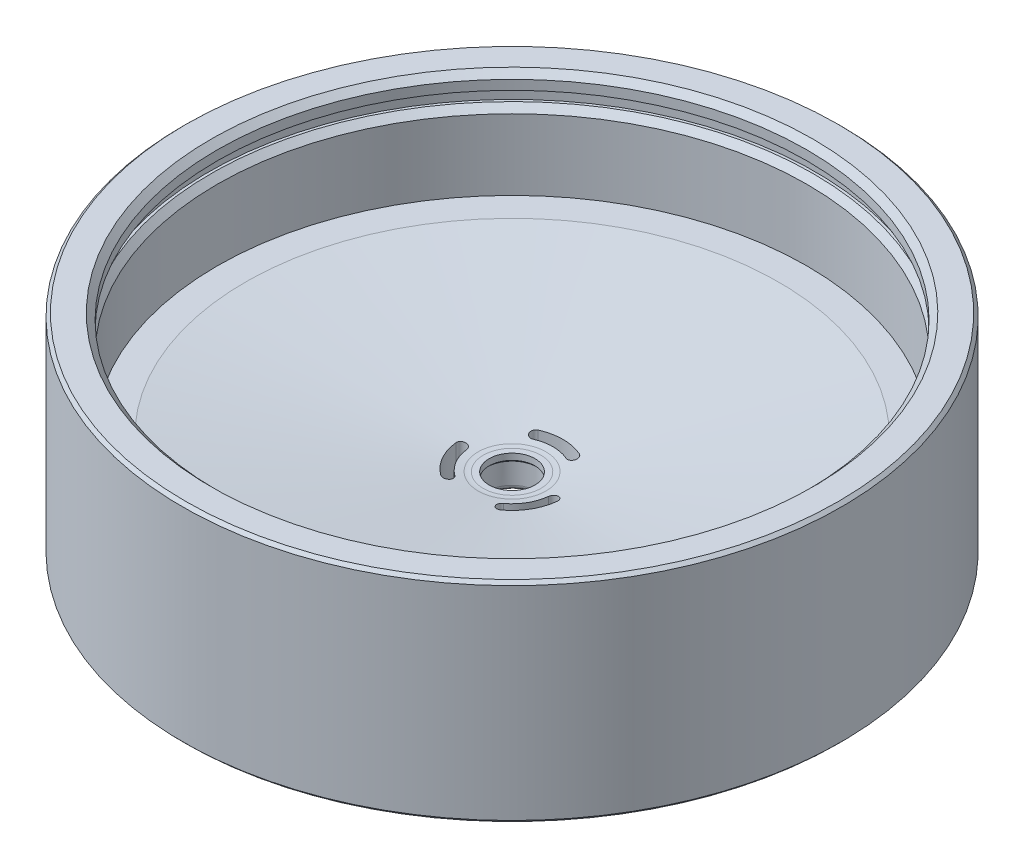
ISO-10303-21;
HEADER;
FILE_DESCRIPTION(('STEP AP214'),'2;1');
FILE_NAME('part.step','',(''),(''),'','','');
FILE_SCHEMA(('AUTOMOTIVE_DESIGN { 1 0 10303 214 1 1 1 1 }'));
ENDSEC;
DATA;
#1=APPLICATION_CONTEXT('core data for automotive mechanical design processes');
#2=APPLICATION_PROTOCOL_DEFINITION('international standard','automotive_design',2000,#1);
#3=PRODUCT_CONTEXT('',#1,'mechanical');
#4=PRODUCT('Part','Part','',(#3));
#5=PRODUCT_RELATED_PRODUCT_CATEGORY('part','',(#4));
#6=PRODUCT_DEFINITION_FORMATION('','',#4);
#7=PRODUCT_DEFINITION_CONTEXT('part definition',#1,'design');
#8=PRODUCT_DEFINITION('design','',#6,#7);
#9=PRODUCT_DEFINITION_SHAPE('','',#8);
#10=(LENGTH_UNIT() NAMED_UNIT(*) SI_UNIT(.MILLI.,.METRE.));
#11=(NAMED_UNIT(*) PLANE_ANGLE_UNIT() SI_UNIT($,.RADIAN.));
#12=(NAMED_UNIT(*) SI_UNIT($,.STERADIAN.) SOLID_ANGLE_UNIT());
#13=UNCERTAINTY_MEASURE_WITH_UNIT(LENGTH_MEASURE(1.E-05),#10,'distance_accuracy_value','');
#14=(GEOMETRIC_REPRESENTATION_CONTEXT(3) GLOBAL_UNCERTAINTY_ASSIGNED_CONTEXT((#13)) GLOBAL_UNIT_ASSIGNED_CONTEXT((#10,
#11,#12)) REPRESENTATION_CONTEXT('',''));
#15=CARTESIAN_POINT('',(0.,0.,0.));
#16=DIRECTION('',(0.,0.,1.));
#17=DIRECTION('',(1.,0.,0.));
#18=AXIS2_PLACEMENT_3D('',#15,#16,#17);
#19=CARTESIAN_POINT('',(0.,-13.9192,0.));
#20=DIRECTION('',(0.,-1.,0.));
#21=DIRECTION('',(0.,0.,-1.));
#22=AXIS2_PLACEMENT_3D('',#19,#20,#21);
#23=PLANE('',#22);
#24=CARTESIAN_POINT('',(0.,-13.9192,0.));
#25=DIRECTION('',(0.,-1.,0.));
#26=DIRECTION('',(0.,0.,-1.));
#27=AXIS2_PLACEMENT_3D('',#24,#25,#26);
#28=CIRCLE('',#27,2.44094);
#29=CARTESIAN_POINT('',(0.,-13.9192,-2.44094));
#30=VERTEX_POINT('',#29);
#31=EDGE_CURVE('E873',#30,#30,#28,.F.);
#32=ORIENTED_EDGE('',*,*,#31,.T.);
#33=EDGE_LOOP('',(#32));
#34=FACE_BOUND('',#33,.T.);
#35=CARTESIAN_POINT('',(0.,-13.9192,0.));
#36=DIRECTION('',(0.,-1.,0.));
#37=DIRECTION('',(0.,0.,-1.));
#38=AXIS2_PLACEMENT_3D('',#35,#36,#37);
#39=CIRCLE('',#38,4.38149999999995);
#40=CARTESIAN_POINT('',(1.76456313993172,-13.9192,-4.01046869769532));
#41=VERTEX_POINT('',#40);
#42=CARTESIAN_POINT('',(-1.76456313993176,-13.9192,-4.01046869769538));
#43=VERTEX_POINT('',#42);
#44=EDGE_CURVE('E827',#41,#43,#39,.F.);
#45=ORIENTED_EDGE('',*,*,#44,.T.);
#46=CARTESIAN_POINT('',(-1.4986,-13.9192,-3.40599225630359));
#47=DIRECTION('',(0.,-1.,0.));
#48=DIRECTION('',(0.,0.,-1.));
#49=AXIS2_PLACEMENT_3D('',#46,#47,#48);
#50=CIRCLE('',#49,0.6604);
#51=CARTESIAN_POINT('',(-1.23263686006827,-13.9192,-2.80151581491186));
#52=VERTEX_POINT('',#51);
#53=EDGE_CURVE('E836',#43,#52,#50,.F.);
#54=ORIENTED_EDGE('',*,*,#53,.T.);
#55=CARTESIAN_POINT('',(0.,-13.9192,0.));
#56=DIRECTION('',(0.,-1.,0.));
#57=DIRECTION('',(0.,0.,-1.));
#58=AXIS2_PLACEMENT_3D('',#55,#56,#57);
#59=CIRCLE('',#58,3.06069999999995);
#60=CARTESIAN_POINT('',(1.23263686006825,-13.9192,-2.80151581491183));
#61=VERTEX_POINT('',#60);
#62=EDGE_CURVE('E833',#52,#61,#59,.T.);
#63=ORIENTED_EDGE('',*,*,#62,.T.);
#64=CARTESIAN_POINT('',(1.4986,-13.9192,-3.40599225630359));
#65=DIRECTION('',(0.,-1.,0.));
#66=DIRECTION('',(0.,0.,-1.));
#67=AXIS2_PLACEMENT_3D('',#64,#65,#66);
#68=CIRCLE('',#67,0.660400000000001);
#69=EDGE_CURVE('E830',#61,#41,#68,.F.);
#70=ORIENTED_EDGE('',*,*,#69,.T.);
#71=EDGE_LOOP('',(#45,#54,#63,#70));
#72=FACE_BOUND('',#71,.T.);
#73=CARTESIAN_POINT('',(-3.69897581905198,-13.9192,0.405170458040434));
#74=DIRECTION('',(0.,-1.,0.));
#75=DIRECTION('',(0.,0.,-1.));
#76=AXIS2_PLACEMENT_3D('',#73,#74,#75);
#77=CIRCLE('',#76,0.660400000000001);
#78=CARTESIAN_POINT('',(-3.04250229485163,-13.9192,0.333263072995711));
#79=VERTEX_POINT('',#78);
#80=CARTESIAN_POINT('',(-4.35544934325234,-13.9192,0.477077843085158));
#81=VERTEX_POINT('',#80);
#82=EDGE_CURVE('E814',#79,#81,#77,.F.);
#83=ORIENTED_EDGE('',*,*,#82,.T.);
#84=CARTESIAN_POINT('',(0.,-13.9192,0.));
#85=DIRECTION('',(0.,-1.,0.));
#86=DIRECTION('',(0.,0.,-1.));
#87=AXIS2_PLACEMENT_3D('',#84,#85,#86);
#88=CIRCLE('',#87,4.38149999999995);
#89=CARTESIAN_POINT('',(-2.59088620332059,-13.9192,3.5333908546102));
#90=VERTEX_POINT('',#89);
#91=EDGE_CURVE('E823',#81,#90,#88,.F.);
#92=ORIENTED_EDGE('',*,*,#91,.T.);
#93=CARTESIAN_POINT('',(-2.20037581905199,-13.9192,3.00082179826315));
#94=DIRECTION('',(0.,-1.,0.));
#95=DIRECTION('',(0.,0.,-1.));
#96=AXIS2_PLACEMENT_3D('',#93,#94,#95);
#97=CIRCLE('',#96,0.6604);
#98=CARTESIAN_POINT('',(-1.80986543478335,-13.9192,2.46825274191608));
#99=VERTEX_POINT('',#98);
#100=EDGE_CURVE('E820',#90,#99,#97,.F.);
#101=ORIENTED_EDGE('',*,*,#100,.T.);
#102=CARTESIAN_POINT('',(0.,-13.9192,0.));
#103=DIRECTION('',(0.,-1.,0.));
#104=DIRECTION('',(0.,0.,-1.));
#105=AXIS2_PLACEMENT_3D('',#102,#103,#104);
#106=CIRCLE('',#105,3.06069999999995);
#107=EDGE_CURVE('E817',#99,#79,#106,.T.);
#108=ORIENTED_EDGE('',*,*,#107,.T.);
#109=EDGE_LOOP('',(#83,#92,#101,#108));
#110=FACE_BOUND('',#109,.T.);
#111=CARTESIAN_POINT('',(0.,-13.9192,0.));
#112=DIRECTION('',(0.,-1.,0.));
#113=DIRECTION('',(0.,0.,-1.));
#114=AXIS2_PLACEMENT_3D('',#111,#112,#113);
#115=CIRCLE('',#114,3.0607000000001);
#116=CARTESIAN_POINT('',(3.04250229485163,-13.9192,0.333263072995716));
#117=VERTEX_POINT('',#116);
#118=CARTESIAN_POINT('',(1.80986543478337,-13.9192,2.46825274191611));
#119=VERTEX_POINT('',#118);
#120=EDGE_CURVE('E801',#117,#119,#115,.T.);
#121=ORIENTED_EDGE('',*,*,#120,.T.);
#122=CARTESIAN_POINT('',(2.20037581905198,-13.9192,3.00082179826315));
#123=DIRECTION('',(0.,-1.,0.));
#124=DIRECTION('',(0.,0.,-1.));
#125=AXIS2_PLACEMENT_3D('',#122,#123,#124);
#126=CIRCLE('',#125,0.660400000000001);
#127=CARTESIAN_POINT('',(2.5908862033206,-13.9192,3.5333908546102));
#128=VERTEX_POINT('',#127);
#129=EDGE_CURVE('E810',#119,#128,#126,.F.);
#130=ORIENTED_EDGE('',*,*,#129,.T.);
#131=CARTESIAN_POINT('',(0.,-13.9192,0.));
#132=DIRECTION('',(0.,-1.,0.));
#133=DIRECTION('',(0.,0.,-1.));
#134=AXIS2_PLACEMENT_3D('',#131,#132,#133);
#135=CIRCLE('',#134,4.3815000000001);
#136=CARTESIAN_POINT('',(4.35544934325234,-13.9192,0.477077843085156));
#137=VERTEX_POINT('',#136);
#138=EDGE_CURVE('E807',#128,#137,#135,.F.);
#139=ORIENTED_EDGE('',*,*,#138,.T.);
#140=CARTESIAN_POINT('',(3.69897581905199,-13.9192,0.405170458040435));
#141=DIRECTION('',(0.,-1.,0.));
#142=DIRECTION('',(0.,0.,-1.));
#143=AXIS2_PLACEMENT_3D('',#140,#141,#142);
#144=CIRCLE('',#143,0.660400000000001);
#145=EDGE_CURVE('E804',#137,#117,#144,.F.);
#146=ORIENTED_EDGE('',*,*,#145,.T.);
#147=EDGE_LOOP('',(#121,#130,#139,#146));
#148=FACE_BOUND('',#147,.T.);
#149=CARTESIAN_POINT('',(0.,-13.9192,0.));
#150=DIRECTION('',(0.,1.,0.));
#151=DIRECTION('',(0.,0.,1.));
#152=AXIS2_PLACEMENT_3D('',#149,#150,#151);
#153=CIRCLE('',#152,15.875);
#154=CARTESIAN_POINT('',(0.,-13.9192,15.875));
#155=VERTEX_POINT('',#154);
#156=EDGE_CURVE('E356',#155,#155,#153,.T.);
#157=ORIENTED_EDGE('',*,*,#156,.F.);
#158=EDGE_LOOP('',(#157));
#159=FACE_BOUND('',#158,.T.);
#160=ADVANCED_FACE('F99',(#34,#72,#110,#148,#159),#23,.T.);
#161=CARTESIAN_POINT('',(0.,11.0345427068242,0.));
#162=DIRECTION('',(0.,1.,0.));
#163=DIRECTION('',(0.,0.,1.));
#164=AXIS2_PLACEMENT_3D('',#161,#162,#163);
#165=CYLINDRICAL_SURFACE('',#164,1.8542);
#166=CARTESIAN_POINT('',(0.,-11.1332,0.));
#167=DIRECTION('',(0.,-1.,0.));
#168=DIRECTION('',(0.,0.,-1.));
#169=AXIS2_PLACEMENT_3D('',#166,#167,#168);
#170=CIRCLE('',#169,1.8542);
#171=CARTESIAN_POINT('',(0.,-11.1332,-1.8542));
#172=VERTEX_POINT('',#171);
#173=EDGE_CURVE('E343',#172,#172,#170,.F.);
#174=ORIENTED_EDGE('',*,*,#173,.T.);
#175=EDGE_LOOP('',(#174));
#176=FACE_BOUND('',#175,.T.);
#177=CARTESIAN_POINT('',(0.,-11.6412,0.));
#178=DIRECTION('',(0.,1.,0.));
#179=DIRECTION('',(0.,0.,1.));
#180=AXIS2_PLACEMENT_3D('',#177,#178,#179);
#181=CIRCLE('',#180,1.8542);
#182=CARTESIAN_POINT('',(0.,-11.6412,1.8542));
#183=VERTEX_POINT('',#182);
#184=EDGE_CURVE('E390',#183,#183,#181,.T.);
#185=ORIENTED_EDGE('',*,*,#184,.F.);
#186=EDGE_LOOP('',(#185));
#187=FACE_BOUND('',#186,.T.);
#188=ADVANCED_FACE('F569',(#176,#187),#165,.F.);
#189=CARTESIAN_POINT('',(0.,11.0345427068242,0.));
#190=DIRECTION('',(0.,1.,0.));
#191=DIRECTION('',(0.,0.,1.));
#192=AXIS2_PLACEMENT_3D('',#189,#190,#191);
#193=CYLINDRICAL_SURFACE('',#192,17.145);
#194=CARTESIAN_POINT('',(0.,-16.9672,0.));
#195=DIRECTION('',(0.,1.,0.));
#196=DIRECTION('',(0.,0.,1.));
#197=AXIS2_PLACEMENT_3D('',#194,#195,#196);
#198=CIRCLE('',#197,17.145);
#199=CARTESIAN_POINT('',(0.,-16.9672,17.145));
#200=VERTEX_POINT('',#199);
#201=EDGE_CURVE('E287',#200,#200,#198,.T.);
#202=ORIENTED_EDGE('',*,*,#201,.T.);
#203=EDGE_LOOP('',(#202));
#204=FACE_BOUND('',#203,.T.);
#205=CARTESIAN_POINT('',(0.,-13.2842,0.));
#206=DIRECTION('',(0.,1.,0.));
#207=DIRECTION('',(0.,0.,1.));
#208=AXIS2_PLACEMENT_3D('',#205,#206,#207);
#209=CIRCLE('',#208,17.145);
#210=CARTESIAN_POINT('',(0.,-13.2842,17.145));
#211=VERTEX_POINT('',#210);
#212=EDGE_CURVE('E347',#211,#211,#209,.T.);
#213=ORIENTED_EDGE('',*,*,#212,.F.);
#214=EDGE_LOOP('',(#213));
#215=FACE_BOUND('',#214,.T.);
#216=ADVANCED_FACE('F577',(#204,#215),#193,.T.);
#217=CARTESIAN_POINT('',(0.,-16.9672,0.));
#218=DIRECTION('',(0.,-1.,0.));
#219=DIRECTION('',(0.,0.,-1.));
#220=AXIS2_PLACEMENT_3D('',#217,#218,#219);
#221=PLANE('',#220);
#222=CARTESIAN_POINT('',(0.,-16.9672,0.));
#223=DIRECTION('',(0.,1.,0.));
#224=DIRECTION('',(0.,0.,1.));
#225=AXIS2_PLACEMENT_3D('',#222,#223,#224);
#226=CIRCLE('',#225,15.875);
#227=CARTESIAN_POINT('',(0.,-16.9672,15.875));
#228=VERTEX_POINT('',#227);
#229=EDGE_CURVE('E352',#228,#228,#226,.T.);
#230=ORIENTED_EDGE('',*,*,#229,.T.);
#231=EDGE_LOOP('',(#230));
#232=FACE_BOUND('',#231,.T.);
#233=ORIENTED_EDGE('',*,*,#201,.F.);
#234=EDGE_LOOP('',(#233));
#235=FACE_BOUND('',#234,.T.);
#236=ADVANCED_FACE('F588',(#232,#235),#221,.T.);
#237=CARTESIAN_POINT('',(0.,11.0345427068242,0.));
#238=DIRECTION('',(0.,1.,0.));
#239=DIRECTION('',(0.,0.,1.));
#240=AXIS2_PLACEMENT_3D('',#237,#238,#239);
#241=CYLINDRICAL_SURFACE('',#240,15.875);
#242=ORIENTED_EDGE('',*,*,#156,.T.);
#243=EDGE_LOOP('',(#242));
#244=FACE_BOUND('',#243,.T.);
#245=ORIENTED_EDGE('',*,*,#229,.F.);
#246=EDGE_LOOP('',(#245));
#247=FACE_BOUND('',#246,.T.);
#248=ADVANCED_FACE('F584',(#244,#247),#241,.F.);
#249=CARTESIAN_POINT('',(0.,-8.636,0.));
#250=DIRECTION('',(0.,-1.,0.));
#251=DIRECTION('',(0.,0.,-1.));
#252=AXIS2_PLACEMENT_3D('',#249,#250,#251);
#253=PLANE('',#252);
#254=CARTESIAN_POINT('',(0.,-8.636,0.));
#255=DIRECTION('',(0.,1.,0.));
#256=DIRECTION('',(0.,0.,1.));
#257=AXIS2_PLACEMENT_3D('',#254,#255,#256);
#258=CIRCLE('',#257,21.59);
#259=CARTESIAN_POINT('',(0.,-8.636,21.59));
#260=VERTEX_POINT('',#259);
#261=EDGE_CURVE('E394',#260,#260,#258,.T.);
#262=ORIENTED_EDGE('',*,*,#261,.F.);
#263=EDGE_LOOP('',(#262));
#264=FACE_BOUND('',#263,.T.);
#265=CARTESIAN_POINT('',(0.,-8.636,0.));
#266=DIRECTION('',(0.,1.,0.));
#267=DIRECTION('',(0.,0.,1.));
#268=AXIS2_PLACEMENT_3D('',#265,#266,#267);
#269=CIRCLE('',#268,23.8633);
#270=CARTESIAN_POINT('',(0.,-8.636,23.8633));
#271=VERTEX_POINT('',#270);
#272=EDGE_CURVE('E360',#271,#271,#269,.T.);
#273=ORIENTED_EDGE('',*,*,#272,.T.);
#274=EDGE_LOOP('',(#273));
#275=FACE_BOUND('',#274,.T.);
#276=ADVANCED_FACE('F587',(#264,#275),#253,.F.);
#277=CARTESIAN_POINT('',(0.,11.0345427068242,0.));
#278=DIRECTION('',(0.,1.,0.));
#279=DIRECTION('',(0.,0.,1.));
#280=AXIS2_PLACEMENT_3D('',#277,#278,#279);
#281=CYLINDRICAL_SURFACE('',#280,23.8633);
#282=CARTESIAN_POINT('',(0.,-2.913,0.));
#283=DIRECTION('',(0.,-1.,0.));
#284=DIRECTION('',(0.,0.,-1.));
#285=AXIS2_PLACEMENT_3D('',#282,#283,#284);
#286=CIRCLE('',#285,23.8633);
#287=CARTESIAN_POINT('',(0.,-2.913,-23.8633));
#288=VERTEX_POINT('',#287);
#289=EDGE_CURVE('E543',#288,#288,#286,.F.);
#290=ORIENTED_EDGE('',*,*,#289,.T.);
#291=EDGE_LOOP('',(#290));
#292=FACE_BOUND('',#291,.T.);
#293=ORIENTED_EDGE('',*,*,#272,.F.);
#294=EDGE_LOOP('',(#293));
#295=FACE_BOUND('',#294,.T.);
#296=ADVANCED_FACE('F695',(#292,#295),#281,.F.);
#297=CARTESIAN_POINT('',(0.,-2.413,0.));
#298=DIRECTION('',(0.,-1.,0.));
#299=DIRECTION('',(0.,0.,-1.));
#300=AXIS2_PLACEMENT_3D('',#297,#298,#299);
#301=PLANE('',#300);
#302=CARTESIAN_POINT('',(0.,-2.413,0.));
#303=DIRECTION('',(0.,-1.,0.));
#304=DIRECTION('',(0.,0.,-1.));
#305=AXIS2_PLACEMENT_3D('',#302,#303,#304);
#306=CIRCLE('',#305,24.3633);
#307=CARTESIAN_POINT('',(0.,-2.413,-24.3633));
#308=VERTEX_POINT('',#307);
#309=EDGE_CURVE('E547',#308,#308,#306,.T.);
#310=ORIENTED_EDGE('',*,*,#309,.T.);
#311=EDGE_LOOP('',(#310));
#312=FACE_BOUND('',#311,.T.);
#313=CARTESIAN_POINT('',(0.,-2.413,0.));
#314=DIRECTION('',(0.,1.,0.));
#315=DIRECTION('',(0.,0.,1.));
#316=AXIS2_PLACEMENT_3D('',#313,#314,#315);
#317=CIRCLE('',#316,24.5745);
#318=CARTESIAN_POINT('',(0.,-2.413,24.5745));
#319=VERTEX_POINT('',#318);
#320=EDGE_CURVE('E364',#319,#319,#317,.T.);
#321=ORIENTED_EDGE('',*,*,#320,.T.);
#322=EDGE_LOOP('',(#321));
#323=FACE_BOUND('',#322,.T.);
#324=ADVANCED_FACE('F706',(#312,#323),#301,.F.);
#325=CARTESIAN_POINT('',(0.,11.0345427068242,0.));
#326=DIRECTION('',(0.,1.,0.));
#327=DIRECTION('',(0.,0.,1.));
#328=AXIS2_PLACEMENT_3D('',#325,#326,#327);
#329=CYLINDRICAL_SURFACE('',#328,24.5745);
#330=ORIENTED_EDGE('',*,*,#320,.F.);
#331=EDGE_LOOP('',(#330));
#332=FACE_BOUND('',#331,.T.);
#333=CARTESIAN_POINT('',(0.,-1.27,0.));
#334=DIRECTION('',(0.,1.,0.));
#335=DIRECTION('',(0.,0.,1.));
#336=AXIS2_PLACEMENT_3D('',#333,#334,#335);
#337=CIRCLE('',#336,24.5745);
#338=CARTESIAN_POINT('',(0.,-1.27,24.5745));
#339=VERTEX_POINT('',#338);
#340=EDGE_CURVE('E368',#339,#339,#337,.T.);
#341=ORIENTED_EDGE('',*,*,#340,.T.);
#342=EDGE_LOOP('',(#341));
#343=FACE_BOUND('',#342,.T.);
#344=ADVANCED_FACE('F699',(#332,#343),#329,.F.);
#345=CARTESIAN_POINT('',(0.,-1.27,0.));
#346=DIRECTION('',(0.,1.,0.));
#347=DIRECTION('',(0.,0.,1.));
#348=AXIS2_PLACEMENT_3D('',#345,#346,#347);
#349=PLANE('',#348);
#350=ORIENTED_EDGE('',*,*,#340,.F.);
#351=EDGE_LOOP('',(#350));
#352=FACE_BOUND('',#351,.T.);
#353=CARTESIAN_POINT('',(0.,-1.27,0.));
#354=DIRECTION('',(0.,1.,0.));
#355=DIRECTION('',(0.,0.,1.));
#356=AXIS2_PLACEMENT_3D('',#353,#354,#355);
#357=CIRCLE('',#356,23.8633);
#358=CARTESIAN_POINT('',(0.,-1.27,23.8633));
#359=VERTEX_POINT('',#358);
#360=EDGE_CURVE('E372',#359,#359,#357,.T.);
#361=ORIENTED_EDGE('',*,*,#360,.T.);
#362=EDGE_LOOP('',(#361));
#363=FACE_BOUND('',#362,.T.);
#364=ADVANCED_FACE('F693',(#352,#363),#349,.F.);
#365=CARTESIAN_POINT('',(0.,-0.499999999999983,0.));
#366=DIRECTION('',(0.,-1.,0.));
#367=DIRECTION('',(0.,0.,-1.));
#368=AXIS2_PLACEMENT_3D('',#365,#366,#367);
#369=CIRCLE('',#368,23.8633);
#370=CARTESIAN_POINT('',(0.,-0.499999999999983,-23.8633));
#371=VERTEX_POINT('',#370);
#372=EDGE_CURVE('E535',#371,#371,#369,.F.);
#373=ORIENTED_EDGE('',*,*,#372,.T.);
#374=EDGE_LOOP('',(#373));
#375=FACE_BOUND('',#374,.T.);
#376=ORIENTED_EDGE('',*,*,#360,.F.);
#377=EDGE_LOOP('',(#376));
#378=FACE_BOUND('',#377,.T.);
#379=ADVANCED_FACE('F689',(#375,#378),#281,.F.);
#380=CARTESIAN_POINT('',(0.,0.,0.));
#381=DIRECTION('',(0.,-1.,0.));
#382=DIRECTION('',(0.,0.,-1.));
#383=AXIS2_PLACEMENT_3D('',#380,#381,#382);
#384=PLANE('',#383);
#385=CARTESIAN_POINT('',(0.,0.,0.));
#386=DIRECTION('',(0.,-1.,0.));
#387=DIRECTION('',(0.,0.,-1.));
#388=AXIS2_PLACEMENT_3D('',#385,#386,#387);
#389=CIRCLE('',#388,24.3633);
#390=CARTESIAN_POINT('',(0.,0.,-24.3633));
#391=VERTEX_POINT('',#390);
#392=EDGE_CURVE('E539',#391,#391,#389,.T.);
#393=ORIENTED_EDGE('',*,*,#392,.T.);
#394=EDGE_LOOP('',(#393));
#395=FACE_BOUND('',#394,.T.);
#396=CARTESIAN_POINT('',(0.,0.,0.));
#397=DIRECTION('',(0.,-1.,0.));
#398=DIRECTION('',(0.,0.,-1.));
#399=AXIS2_PLACEMENT_3D('',#396,#397,#398);
#400=CIRCLE('',#399,26.416);
#401=CARTESIAN_POINT('',(0.,0.,-26.416));
#402=VERTEX_POINT('',#401);
#403=EDGE_CURVE('E531',#402,#402,#400,.F.);
#404=ORIENTED_EDGE('',*,*,#403,.T.);
#405=EDGE_LOOP('',(#404));
#406=FACE_BOUND('',#405,.T.);
#407=ADVANCED_FACE('F692',(#395,#406),#384,.F.);
#408=CARTESIAN_POINT('',(0.,11.0345427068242,0.));
#409=DIRECTION('',(0.,1.,0.));
#410=DIRECTION('',(0.,0.,1.));
#411=AXIS2_PLACEMENT_3D('',#408,#409,#410);
#412=CYLINDRICAL_SURFACE('',#411,26.67);
#413=CARTESIAN_POINT('',(0.,-16.7132,0.));
#414=DIRECTION('',(0.,-1.,0.));
#415=DIRECTION('',(0.,0.,-1.));
#416=AXIS2_PLACEMENT_3D('',#413,#414,#415);
#417=CIRCLE('',#416,26.67);
#418=CARTESIAN_POINT('',(0.,-16.7132,-26.67));
#419=VERTEX_POINT('',#418);
#420=EDGE_CURVE('E523',#419,#419,#417,.F.);
#421=ORIENTED_EDGE('',*,*,#420,.T.);
#422=EDGE_LOOP('',(#421));
#423=FACE_BOUND('',#422,.T.);
#424=CARTESIAN_POINT('',(0.,-0.25399999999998,0.));
#425=DIRECTION('',(0.,-1.,0.));
#426=DIRECTION('',(0.,0.,-1.));
#427=AXIS2_PLACEMENT_3D('',#424,#425,#426);
#428=CIRCLE('',#427,26.67);
#429=CARTESIAN_POINT('',(0.,-0.25399999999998,-26.67));
#430=VERTEX_POINT('',#429);
#431=EDGE_CURVE('E519',#430,#430,#428,.T.);
#432=ORIENTED_EDGE('',*,*,#431,.T.);
#433=EDGE_LOOP('',(#432));
#434=FACE_BOUND('',#433,.T.);
#435=ADVANCED_FACE('F1025',(#423,#434),#412,.T.);
#436=CARTESIAN_POINT('',(0.,-16.9672,0.));
#437=DIRECTION('',(0.,-1.,0.));
#438=DIRECTION('',(0.,0.,-1.));
#439=AXIS2_PLACEMENT_3D('',#436,#437,#438);
#440=PLANE('',#439);
#441=CARTESIAN_POINT('',(0.,-16.9672,0.));
#442=DIRECTION('',(0.,-1.,0.));
#443=DIRECTION('',(0.,0.,-1.));
#444=AXIS2_PLACEMENT_3D('',#441,#442,#443);
#445=CIRCLE('',#444,26.416);
#446=CARTESIAN_POINT('',(0.,-16.9672,-26.416));
#447=VERTEX_POINT('',#446);
#448=EDGE_CURVE('E527',#447,#447,#445,.T.);
#449=ORIENTED_EDGE('',*,*,#448,.T.);
#450=EDGE_LOOP('',(#449));
#451=FACE_BOUND('',#450,.T.);
#452=CARTESIAN_POINT('',(0.,-16.9672,0.));
#453=DIRECTION('',(0.,1.,0.));
#454=DIRECTION('',(0.,0.,1.));
#455=AXIS2_PLACEMENT_3D('',#452,#453,#454);
#456=CIRCLE('',#455,25.4);
#457=CARTESIAN_POINT('',(0.,-16.9672,25.4));
#458=VERTEX_POINT('',#457);
#459=EDGE_CURVE('E376',#458,#458,#456,.T.);
#460=ORIENTED_EDGE('',*,*,#459,.T.);
#461=EDGE_LOOP('',(#460));
#462=FACE_BOUND('',#461,.T.);
#463=ADVANCED_FACE('F1020',(#451,#462),#440,.T.);
#464=CARTESIAN_POINT('',(0.,11.0345427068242,0.));
#465=DIRECTION('',(0.,1.,0.));
#466=DIRECTION('',(0.,0.,1.));
#467=AXIS2_PLACEMENT_3D('',#464,#465,#466);
#468=CYLINDRICAL_SURFACE('',#467,25.4);
#469=CARTESIAN_POINT('',(0.,-13.2842,0.));
#470=DIRECTION('',(0.,1.,0.));
#471=DIRECTION('',(0.,0.,1.));
#472=AXIS2_PLACEMENT_3D('',#469,#470,#471);
#473=CIRCLE('',#472,25.4);
#474=CARTESIAN_POINT('',(0.,-13.2842,25.4));
#475=VERTEX_POINT('',#474);
#476=EDGE_CURVE('E380',#475,#475,#473,.T.);
#477=ORIENTED_EDGE('',*,*,#476,.T.);
#478=EDGE_LOOP('',(#477));
#479=FACE_BOUND('',#478,.T.);
#480=ORIENTED_EDGE('',*,*,#459,.F.);
#481=EDGE_LOOP('',(#480));
#482=FACE_BOUND('',#481,.T.);
#483=ADVANCED_FACE('F1015',(#479,#482),#468,.F.);
#484=CARTESIAN_POINT('',(0.,-13.2842,0.));
#485=DIRECTION('',(0.,-1.,0.));
#486=DIRECTION('',(0.,0.,-1.));
#487=AXIS2_PLACEMENT_3D('',#484,#485,#486);
#488=PLANE('',#487);
#489=DIRECTION('',(0.,0.,-1.));
#490=VECTOR('',#489,1.);
#491=CARTESIAN_POINT('',(-3.81,-13.2842,18.7325));
#492=LINE('',#491,#490);
#493=CARTESIAN_POINT('',(-3.81,-13.2842,22.2123));
#494=VERTEX_POINT('',#493);
#495=CARTESIAN_POINT('',(-3.81,-13.2842,20.3327));
#496=VERTEX_POINT('',#495);
#497=EDGE_CURVE('E451',#494,#496,#492,.T.);
#498=ORIENTED_EDGE('',*,*,#497,.F.);
#499=CARTESIAN_POINT('',(-2.2098,-13.2842,22.2123));
#500=DIRECTION('',(0.,-1.,0.));
#501=DIRECTION('',(0.,0.,-1.));
#502=AXIS2_PLACEMENT_3D('',#499,#500,#501);
#503=CIRCLE('',#502,1.6002);
#504=CARTESIAN_POINT('',(-2.2098,-13.2842,23.8125));
#505=VERTEX_POINT('',#504);
#506=EDGE_CURVE('E512',#494,#505,#503,.F.);
#507=ORIENTED_EDGE('',*,*,#506,.T.);
#508=DIRECTION('',(-1.,0.,0.));
#509=VECTOR('',#508,1.);
#510=CARTESIAN_POINT('',(3.81,-13.2842,23.8125));
#511=LINE('',#510,#509);
#512=CARTESIAN_POINT('',(2.2098,-13.2842,23.8125));
#513=VERTEX_POINT('',#512);
#514=EDGE_CURVE('E439',#513,#505,#511,.T.);
#515=ORIENTED_EDGE('',*,*,#514,.F.);
#516=CARTESIAN_POINT('',(2.2098,-13.2842,22.2123));
#517=DIRECTION('',(0.,-1.,0.));
#518=DIRECTION('',(0.,0.,-1.));
#519=AXIS2_PLACEMENT_3D('',#516,#517,#518);
#520=CIRCLE('',#519,1.6002);
#521=CARTESIAN_POINT('',(3.81,-13.2842,22.2123));
#522=VERTEX_POINT('',#521);
#523=EDGE_CURVE('E115',#513,#522,#520,.F.);
#524=ORIENTED_EDGE('',*,*,#523,.T.);
#525=DIRECTION('',(0.,0.,1.));
#526=VECTOR('',#525,1.);
#527=CARTESIAN_POINT('',(3.81,-13.2842,18.7325));
#528=LINE('',#527,#526);
#529=CARTESIAN_POINT('',(3.81,-13.2842,20.3327));
#530=VERTEX_POINT('',#529);
#531=EDGE_CURVE('E444',#530,#522,#528,.T.);
#532=ORIENTED_EDGE('',*,*,#531,.F.);
#533=CARTESIAN_POINT('',(2.2098,-13.2842,20.3327));
#534=DIRECTION('',(0.,-1.,0.));
#535=DIRECTION('',(0.,0.,-1.));
#536=AXIS2_PLACEMENT_3D('',#533,#534,#535);
#537=CIRCLE('',#536,1.6002);
#538=CARTESIAN_POINT('',(2.2098,-13.2842,18.7325));
#539=VERTEX_POINT('',#538);
#540=EDGE_CURVE('E123',#530,#539,#537,.F.);
#541=ORIENTED_EDGE('',*,*,#540,.T.);
#542=DIRECTION('',(1.,0.,0.));
#543=VECTOR('',#542,1.);
#544=CARTESIAN_POINT('',(3.81,-13.2842,18.7325));
#545=LINE('',#544,#543);
#546=CARTESIAN_POINT('',(-2.2098,-13.2842,18.7325));
#547=VERTEX_POINT('',#546);
#548=EDGE_CURVE('E447',#547,#539,#545,.T.);
#549=ORIENTED_EDGE('',*,*,#548,.F.);
#550=CARTESIAN_POINT('',(-2.2098,-13.2842,20.3327));
#551=DIRECTION('',(0.,-1.,0.));
#552=DIRECTION('',(0.,0.,-1.));
#553=AXIS2_PLACEMENT_3D('',#550,#551,#552);
#554=CIRCLE('',#553,1.6002);
#555=EDGE_CURVE('E509',#547,#496,#554,.F.);
#556=ORIENTED_EDGE('',*,*,#555,.T.);
#557=EDGE_LOOP('',(#498,#507,#515,#524,#532,#541,#549,#556));
#558=FACE_BOUND('',#557,.T.);
#559=ORIENTED_EDGE('',*,*,#212,.T.);
#560=EDGE_LOOP('',(#559));
#561=FACE_BOUND('',#560,.T.);
#562=ORIENTED_EDGE('',*,*,#476,.F.);
#563=EDGE_LOOP('',(#562));
#564=FACE_BOUND('',#563,.T.);
#565=ADVANCED_FACE('F948',(#558,#561,#564),#488,.T.);
#566=CARTESIAN_POINT('',(0.,-11.1332,0.));
#567=DIRECTION('',(0.,-1.,0.));
#568=DIRECTION('',(0.,0.,-1.));
#569=AXIS2_PLACEMENT_3D('',#566,#567,#568);
#570=PLANE('',#569);
#571=CARTESIAN_POINT('',(0.,-11.1332,0.));
#572=DIRECTION('',(0.,-1.,0.));
#573=DIRECTION('',(0.,0.,-1.));
#574=AXIS2_PLACEMENT_3D('',#571,#572,#573);
#575=CIRCLE('',#574,2.33115477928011);
#576=CARTESIAN_POINT('',(0.,-11.1332,-2.33115477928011));
#577=VERTEX_POINT('',#576);
#578=EDGE_CURVE('E108',#577,#577,#575,.F.);
#579=ORIENTED_EDGE('',*,*,#578,.T.);
#580=EDGE_LOOP('',(#579));
#581=FACE_BOUND('',#580,.T.);
#582=ORIENTED_EDGE('',*,*,#173,.F.);
#583=EDGE_LOOP('',(#582));
#584=FACE_BOUND('',#583,.T.);
#585=ADVANCED_FACE('F555',(#581,#584),#570,.F.);
#586=CARTESIAN_POINT('',(0.,1.75025523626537,0.));
#587=DIRECTION('',(0.,1.,0.));
#588=DIRECTION('',(0.,0.,1.));
#589=AXIS2_PLACEMENT_3D('',#586,#587,#588);
#590=CYLINDRICAL_SURFACE('',#589,2.0447);
#591=CARTESIAN_POINT('',(0.,-13.52296,0.));
#592=DIRECTION('',(0.,-1.,0.));
#593=DIRECTION('',(0.,0.,-1.));
#594=AXIS2_PLACEMENT_3D('',#591,#592,#593);
#595=CIRCLE('',#594,2.0447);
#596=CARTESIAN_POINT('',(0.,-13.52296,-2.0447));
#597=VERTEX_POINT('',#596);
#598=EDGE_CURVE('E917',#597,#597,#595,.T.);
#599=ORIENTED_EDGE('',*,*,#598,.T.);
#600=EDGE_LOOP('',(#599));
#601=FACE_BOUND('',#600,.T.);
#602=CARTESIAN_POINT('',(0.,-11.8317,0.));
#603=DIRECTION('',(0.,1.,0.));
#604=DIRECTION('',(0.,0.,1.));
#605=AXIS2_PLACEMENT_3D('',#602,#603,#604);
#606=CIRCLE('',#605,2.0447);
#607=CARTESIAN_POINT('',(0.,-11.8317,2.0447));
#608=VERTEX_POINT('',#607);
#609=EDGE_CURVE('E348',#608,#608,#606,.T.);
#610=ORIENTED_EDGE('',*,*,#609,.T.);
#611=EDGE_LOOP('',(#610));
#612=FACE_BOUND('',#611,.T.);
#613=ADVANCED_FACE('F730',(#601,#612),#590,.F.);
#614=CARTESIAN_POINT('',(0.,-11.8317,0.));
#615=DIRECTION('',(0.,-1.,0.));
#616=DIRECTION('',(0.,0.,-1.));
#617=AXIS2_PLACEMENT_3D('',#614,#615,#616);
#618=CONICAL_SURFACE('',#617,2.0447,0.785398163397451);
#619=ORIENTED_EDGE('',*,*,#184,.T.);
#620=EDGE_LOOP('',(#619));
#621=FACE_BOUND('',#620,.T.);
#622=ORIENTED_EDGE('',*,*,#609,.F.);
#623=EDGE_LOOP('',(#622));
#624=FACE_BOUND('',#623,.T.);
#625=ADVANCED_FACE('F725',(#621,#624),#618,.F.);
#626=CARTESIAN_POINT('',(0.,-8.636,0.));
#627=DIRECTION('',(0.,1.,0.));
#628=DIRECTION('',(0.,0.,1.));
#629=AXIS2_PLACEMENT_3D('',#626,#627,#628);
#630=CONICAL_SURFACE('',#629,21.59,1.44045291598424);
#631=CARTESIAN_POINT('',(0.,-11.1060554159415,0.));
#632=DIRECTION('',(0.,1.,0.));
#633=DIRECTION('',(0.,0.,1.));
#634=AXIS2_PLACEMENT_3D('',#631,#632,#633);
#635=CIRCLE('',#634,2.74707365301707);
#636=CARTESIAN_POINT('',(0.,-11.1060554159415,2.74707365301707));
#637=VERTEX_POINT('',#636);
#638=EDGE_CURVE('E13',#637,#637,#635,.F.);
#639=ORIENTED_EDGE('',*,*,#638,.T.);
#640=EDGE_LOOP('',(#639));
#641=FACE_BOUND('',#640,.T.);
#642=CARTESIAN_POINT('',(0.,-10.9251,0.));
#643=DIRECTION('',(0.,1.,0.));
#644=DIRECTION('',(0.,0.,1.));
#645=AXIS2_PLACEMENT_3D('',#642,#643,#644);
#646=CIRCLE('',#645,4.12749999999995);
#647=CARTESIAN_POINT('',(-1.6622696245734,-10.9251,-3.77797775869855));
#648=VERTEX_POINT('',#647);
#649=CARTESIAN_POINT('',(1.66226962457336,-10.9251,-3.77797775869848));
#650=VERTEX_POINT('',#649);
#651=EDGE_CURVE('E737',#648,#650,#646,.F.);
#652=ORIENTED_EDGE('',*,*,#651,.T.);
#653=CARTESIAN_POINT('',(1.66181431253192,-10.9251000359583,-3.77817775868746));
#654=CARTESIAN_POINT('',(1.68265243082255,-10.9250949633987,-3.76906141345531));
#655=CARTESIAN_POINT('',(1.70270209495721,-10.9253189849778,-3.75816360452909));
#656=CARTESIAN_POINT('',(1.74068693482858,-10.9262120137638,-3.73320239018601));
#657=CARTESIAN_POINT('',(1.75862403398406,-10.9268806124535,-3.71914189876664));
#658=CARTESIAN_POINT('',(1.79189302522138,-10.9286499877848,-3.68822826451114));
#659=CARTESIAN_POINT('',(1.80722386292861,-10.9297509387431,-3.67137399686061));
#660=CARTESIAN_POINT('',(1.83484653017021,-10.932359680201,-3.63536905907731));
#661=CARTESIAN_POINT('',(1.84713880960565,-10.9338674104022,-3.61621872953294));
#662=CARTESIAN_POINT('',(1.86838197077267,-10.9372610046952,-3.57610655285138));
#663=CARTESIAN_POINT('',(1.87732313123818,-10.9391479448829,-3.55513964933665));
#664=CARTESIAN_POINT('',(1.89157757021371,-10.943254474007,-3.51203472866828));
#665=CARTESIAN_POINT('',(1.89689021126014,-10.9454741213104,-3.48989650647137));
#666=CARTESIAN_POINT('',(1.90377385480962,-10.9502099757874,-3.44492674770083));
#667=CARTESIAN_POINT('',(1.90532011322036,-10.9527280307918,-3.42209161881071));
#668=CARTESIAN_POINT('',(1.90456973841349,-10.9579883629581,-3.37651212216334));
#669=CARTESIAN_POINT('',(1.90227319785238,-10.9607306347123,-3.35376775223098));
#670=CARTESIAN_POINT('',(1.89388308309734,-10.9663919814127,-3.30884230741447));
#671=CARTESIAN_POINT('',(1.887762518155,-10.9693121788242,-3.28666641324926));
#672=CARTESIAN_POINT('',(1.87187989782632,-10.9752355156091,-3.24367044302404));
#673=CARTESIAN_POINT('',(1.86211763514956,-10.9782386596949,-3.2228504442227));
#674=CARTESIAN_POINT('',(1.83917221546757,-10.9842604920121,-3.18305361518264));
#675=CARTESIAN_POINT('',(1.82597263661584,-10.9872791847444,-3.16408625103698));
#676=CARTESIAN_POINT('',(1.7965469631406,-10.9932294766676,-3.12864953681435));
#677=CARTESIAN_POINT('',(1.78032084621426,-10.9961610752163,-3.11218020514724));
#678=CARTESIAN_POINT('',(1.74529348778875,-11.0018466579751,-3.08221048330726));
#679=CARTESIAN_POINT('',(1.72649181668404,-11.0046006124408,-3.06871058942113));
#680=CARTESIAN_POINT('',(1.68684501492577,-11.0098386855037,-3.04508055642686));
#681=CARTESIAN_POINT('',(1.66600002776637,-11.0123228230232,-3.03495018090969));
#682=CARTESIAN_POINT('',(1.6229815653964,-11.0169198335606,-3.01841231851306));
#683=CARTESIAN_POINT('',(1.60081636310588,-11.0190347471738,-3.01198388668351));
#684=CARTESIAN_POINT('',(1.55567489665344,-11.0228315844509,-3.00296227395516));
#685=CARTESIAN_POINT('',(1.53269841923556,-11.0245133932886,-3.00037010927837));
#686=CARTESIAN_POINT('',(1.48681278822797,-11.0273637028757,-2.99912065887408));
#687=CARTESIAN_POINT('',(1.46390484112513,-11.0285366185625,-3.00042872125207));
#688=CARTESIAN_POINT('',(1.41864459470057,-11.0303403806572,-3.00688250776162));
#689=CARTESIAN_POINT('',(1.39629146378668,-11.0309720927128,-3.01202207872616));
#690=CARTESIAN_POINT('',(1.36100895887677,-11.0315403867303,-3.02332597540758));
#691=CARTESIAN_POINT('',(1.34771417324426,-11.0316495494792,-3.02836670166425));
#692=CARTESIAN_POINT('',(1.3347303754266,-11.0316471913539,-3.03409481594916));
#693=B_SPLINE_CURVE_WITH_KNOTS('',3,(#653,#654,#655,#656,#657,#658,#659,#660,#661,#662,#663,
#664,#665,#666,#667,#668,#669,#670,#671,#672,#673,#674,#675,#676,#677,#678,#679,#680,#681,#682,
#683,#684,#685,#686,#687,#688,#689,#690,#691,#692),.UNSPECIFIED.,.F.,.F.,(4,2,2,2,2,2,2,2,2,2,2,
2,2,2,2,2,2,2,2,4),(0.,0.0681425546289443,0.136222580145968,0.204330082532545,0.272427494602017,
0.340720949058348,0.409026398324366,0.477779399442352,0.546530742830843,0.615772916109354,
0.685019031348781,0.754602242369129,0.82418596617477,0.893781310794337,0.96337177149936,
1.03256453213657,1.10177561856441,1.1703736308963,1.23886171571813,1.28143509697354),.UNSPECIFIED.);
#694=CARTESIAN_POINT('',(1.3349303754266,-11.0316472,-3.03400675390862));
#695=VERTEX_POINT('',#694);
#696=EDGE_CURVE('E789',#650,#695,#693,.T.);
#697=ORIENTED_EDGE('',*,*,#696,.T.);
#698=CARTESIAN_POINT('',(0.,-11.0316472,0.));
#699=DIRECTION('',(0.,1.,0.));
#700=DIRECTION('',(0.,0.,1.));
#701=AXIS2_PLACEMENT_3D('',#698,#699,#700);
#702=CIRCLE('',#701,3.31469999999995);
#703=CARTESIAN_POINT('',(-1.3349303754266,-11.0316472,-3.03400675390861));
#704=VERTEX_POINT('',#703);
#705=EDGE_CURVE('E752',#695,#704,#702,.T.);
#706=ORIENTED_EDGE('',*,*,#705,.T.);
#707=CARTESIAN_POINT('',(-1.33473037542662,-11.0316471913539,-3.03409481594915));
#708=CARTESIAN_POINT('',(-1.35548878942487,-11.0316530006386,-3.02492595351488));
#709=CARTESIAN_POINT('',(-1.37702263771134,-11.0313712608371,-3.01753525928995));
#710=CARTESIAN_POINT('',(-1.42098259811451,-11.0302626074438,-3.0064357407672));
#711=CARTESIAN_POINT('',(-1.44340774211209,-11.0294362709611,-3.00272302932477));
#712=CARTESIAN_POINT('',(-1.48854618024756,-11.0272678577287,-2.99908447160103));
#713=CARTESIAN_POINT('',(-1.51125957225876,-11.0259256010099,-2.99915994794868));
#714=CARTESIAN_POINT('',(-1.55632283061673,-11.0227800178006,-3.00307759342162));
#715=CARTESIAN_POINT('',(-1.5786727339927,-11.0209767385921,-3.00691937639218));
#716=CARTESIAN_POINT('',(-1.62250197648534,-11.0169665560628,-3.01827534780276));
#717=CARTESIAN_POINT('',(-1.64397636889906,-11.0147576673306,-3.02580791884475));
#718=CARTESIAN_POINT('',(-1.68534503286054,-11.0100212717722,-3.04432808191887));
#719=CARTESIAN_POINT('',(-1.70523900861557,-11.0074937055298,-3.05531631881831));
#720=CARTESIAN_POINT('',(-1.74308428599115,-11.0021792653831,-3.08055306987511));
#721=CARTESIAN_POINT('',(-1.761014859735,-10.9993901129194,-3.09483219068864));
#722=CARTESIAN_POINT('',(-1.7942139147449,-10.9936629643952,-3.1261804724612));
#723=CARTESIAN_POINT('',(-1.80948244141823,-10.9907249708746,-3.14324958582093));
#724=CARTESIAN_POINT('',(-1.83704299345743,-10.9847652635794,-3.17983785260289));
#725=CARTESIAN_POINT('',(-1.84931150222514,-10.9817430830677,-3.19937464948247));
#726=CARTESIAN_POINT('',(-1.87037502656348,-10.9757230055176,-3.24024303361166));
#727=CARTESIAN_POINT('',(-1.87916988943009,-10.9727251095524,-3.26157469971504));
#728=CARTESIAN_POINT('',(-1.89304894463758,-10.9668280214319,-3.30548196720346));
#729=CARTESIAN_POINT('',(-1.89812445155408,-10.9639290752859,-3.32806034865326));
#730=CARTESIAN_POINT('',(-1.90437707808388,-10.9583127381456,-3.37377296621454));
#731=CARTESIAN_POINT('',(-1.90555425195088,-10.9555953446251,-3.39690719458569));
#732=CARTESIAN_POINT('',(-1.9039660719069,-10.9504182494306,-3.44299749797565));
#733=CARTESIAN_POINT('',(-1.90121278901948,-10.9479577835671,-3.46595390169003));
#734=CARTESIAN_POINT('',(-1.8918494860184,-10.9433449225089,-3.51109750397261));
#735=CARTESIAN_POINT('',(-1.88523977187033,-10.9411925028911,-3.53328476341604));
#736=CARTESIAN_POINT('',(-1.86839674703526,-10.9372599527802,-3.57610125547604));
#737=CARTESIAN_POINT('',(-1.85818793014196,-10.9354774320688,-3.59673990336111));
#738=CARTESIAN_POINT('',(-1.83441505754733,-10.9323075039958,-3.63602783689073));
#739=CARTESIAN_POINT('',(-1.82085008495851,-10.9309202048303,-3.65467657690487));
#740=CARTESIAN_POINT('',(-1.79085046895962,-10.9285808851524,-3.68931632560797));
#741=CARTESIAN_POINT('',(-1.77443523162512,-10.927626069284,-3.70532396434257));
#742=CARTESIAN_POINT('',(-1.73915772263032,-10.9261613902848,-3.73434053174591));
#743=CARTESIAN_POINT('',(-1.72029929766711,-10.9256508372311,-3.74735408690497));
#744=CARTESIAN_POINT('',(-1.68795606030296,-10.9251866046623,-3.76587574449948));
#745=CARTESIAN_POINT('',(-1.67503852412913,-10.9250973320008,-3.77238571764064));
#746=CARTESIAN_POINT('',(-1.66181431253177,-10.9251000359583,-3.77817775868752));
#747=B_SPLINE_CURVE_WITH_KNOTS('',3,(#707,#708,#709,#710,#711,#712,#713,#714,#715,#716,#717,
#718,#719,#720,#721,#722,#723,#724,#725,#726,#727,#728,#729,#730,#731,#732,#733,#734,#735,#736,
#737,#738,#739,#740,#741,#742,#743,#744,#745,#746),.UNSPECIFIED.,.F.,.F.,(4,2,2,2,2,2,2,2,2,2,2,
2,2,2,2,2,2,2,2,4),(0.,0.0679857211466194,0.135899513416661,0.203837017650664,0.271767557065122,
0.340039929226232,0.40832504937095,0.47727289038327,0.546219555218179,0.61569050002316,
0.68516449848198,0.7548002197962,0.824434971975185,0.893856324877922,0.96327217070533,
1.03222444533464,1.10119557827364,1.16971432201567,1.2381264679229,1.2814364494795),.UNSPECIFIED.);
#748=EDGE_CURVE('E971',#704,#648,#747,.T.);
#749=ORIENTED_EDGE('',*,*,#748,.T.);
#750=EDGE_LOOP('',(#652,#697,#706,#749));
#751=FACE_BOUND('',#750,.T.);
#752=CARTESIAN_POINT('',(0.,-10.9251,0.));
#753=DIRECTION('',(0.,1.,0.));
#754=DIRECTION('',(0.,0.,1.));
#755=AXIS2_PLACEMENT_3D('',#752,#753,#754);
#756=CIRCLE('',#755,4.12749999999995);
#757=CARTESIAN_POINT('',(-2.4406899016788,-10.9251,3.328556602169));
#758=VERTEX_POINT('',#757);
#759=CARTESIAN_POINT('',(-4.10295952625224,-10.9251,0.449421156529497));
#760=VERTEX_POINT('',#759);
#761=EDGE_CURVE('E741',#758,#760,#756,.F.);
#762=ORIENTED_EDGE('',*,*,#761,.T.);
#763=CARTESIAN_POINT('',(-4.10293756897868,-10.925100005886,0.449621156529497));
#764=CARTESIAN_POINT('',(-4.10544518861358,-10.9250968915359,0.427014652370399));
#765=CARTESIAN_POINT('',(-4.10601560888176,-10.9253228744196,0.404201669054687));
#766=CARTESIAN_POINT('',(-4.10335786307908,-10.9262197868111,0.358826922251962));
#767=CARTESIAN_POINT('',(-4.10013318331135,-10.9268903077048,0.336264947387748));
#768=CARTESIAN_POINT('',(-4.08996332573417,-10.9286634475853,0.292003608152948));
#769=CARTESIAN_POINT('',(-4.08301664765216,-10.9297662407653,0.270304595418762));
#770=CARTESIAN_POINT('',(-4.06561612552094,-10.9323785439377,0.228392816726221));
#771=CARTESIAN_POINT('',(-4.05516280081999,-10.9338879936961,0.208179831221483));
#772=CARTESIAN_POINT('',(-4.03101802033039,-10.9372848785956,0.169744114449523));
#773=CARTESIAN_POINT('',(-4.01731731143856,-10.9391733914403,0.151527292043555));
#774=CARTESIAN_POINT('',(-3.98708957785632,-10.9432828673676,0.117652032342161));
#775=CARTESIAN_POINT('',(-3.97056205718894,-10.9455038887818,0.101994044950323));
#776=CARTESIAN_POINT('',(-3.93503778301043,-10.9502422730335,0.0735735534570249));
#777=CARTESIAN_POINT('',(-3.91602555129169,-10.9527614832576,0.0608307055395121));
#778=CARTESIAN_POINT('',(-3.87616066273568,-10.9580238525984,0.0387198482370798));
#779=CARTESIAN_POINT('',(-3.85530805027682,-10.9607670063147,0.0293517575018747));
#780=CARTESIAN_POINT('',(-3.81219474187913,-10.9664298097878,0.0141866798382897));
#781=CARTESIAN_POINT('',(-3.7899250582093,-10.9693505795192,0.00841565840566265));
#782=CARTESIAN_POINT('',(-3.74474188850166,-10.9752747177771,0.000705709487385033));
#783=CARTESIAN_POINT('',(-3.72182836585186,-10.9782780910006,-0.0012329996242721));
#784=CARTESIAN_POINT('',(-3.67589010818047,-10.9842999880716,-0.00122605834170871));
#785=CARTESIAN_POINT('',(-3.65286537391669,-10.9873185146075,0.000738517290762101));
#786=CARTESIAN_POINT('',(-3.60746883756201,-10.9932680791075,0.00853730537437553));
#787=CARTESIAN_POINT('',(-3.58509703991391,-10.9961991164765,0.0143715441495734));
#788=CARTESIAN_POINT('',(-3.54164009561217,-11.0018831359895,0.0297536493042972));
#789=CARTESIAN_POINT('',(-3.52055514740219,-11.0046360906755,0.0393020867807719));
#790=CARTESIAN_POINT('',(-3.48028430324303,-11.009871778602,0.0618521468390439));
#791=CARTESIAN_POINT('',(-3.46109827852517,-11.0123545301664,0.0748535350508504));
#792=CARTESIAN_POINT('',(-3.42528848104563,-11.0169483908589,0.1038662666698));
#793=CARTESIAN_POINT('',(-3.40865067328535,-11.0190615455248,0.119859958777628));
#794=CARTESIAN_POINT('',(-3.3782930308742,-11.02285453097,0.154464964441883));
#795=CARTESIAN_POINT('',(-3.36457394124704,-11.0245342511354,0.173076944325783));
#796=CARTESIAN_POINT('',(-3.34057860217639,-11.0273801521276,0.212207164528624));
#797=CARTESIAN_POINT('',(-3.33027287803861,-11.0285507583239,0.232707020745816));
#798=CARTESIAN_POINT('',(-3.31326344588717,-11.0303497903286,0.275141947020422));
#799=CARTESIAN_POINT('',(-3.30655412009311,-11.0309790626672,0.297074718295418));
#800=CARTESIAN_POINT('',(-3.29863294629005,-11.0315503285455,0.333731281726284));
#801=CARTESIAN_POINT('',(-3.29631251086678,-11.0316578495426,0.348220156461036));
#802=CARTESIAN_POINT('',(-3.29479211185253,-11.0316465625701,0.362785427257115));
#803=B_SPLINE_CURVE_WITH_KNOTS('',3,(#763,#764,#765,#766,#767,#768,#769,#770,#771,#772,#773,
#774,#775,#776,#777,#778,#779,#780,#781,#782,#783,#784,#785,#786,#787,#788,#789,#790,#791,#792,
#793,#794,#795,#796,#797,#798,#799,#800,#801,#802),.UNSPECIFIED.,.F.,.F.,(4,2,2,2,2,2,2,2,2,2,2,
2,2,2,2,2,2,2,2,4),(0.,0.0681430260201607,0.136223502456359,0.204331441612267,0.272429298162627,
0.340723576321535,0.409029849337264,0.477783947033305,0.546536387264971,0.615779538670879,
0.685026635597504,0.754610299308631,0.824194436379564,0.893789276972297,0.963379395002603,
1.03257125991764,1.10178076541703,1.17037603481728,1.23886383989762,1.28279484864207),.UNSPECIFIED.);
#804=CARTESIAN_POINT('',(-3.29499211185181,-11.0316472,0.360919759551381));
#805=VERTEX_POINT('',#804);
#806=EDGE_CURVE('E742',#760,#805,#803,.T.);
#807=ORIENTED_EDGE('',*,*,#806,.T.);
#808=CARTESIAN_POINT('',(0.,-11.0316472,0.));
#809=DIRECTION('',(0.,1.,0.));
#810=DIRECTION('',(0.,0.,1.));
#811=AXIS2_PLACEMENT_3D('',#808,#809,#810);
#812=CIRCLE('',#811,3.31469999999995);
#813=CARTESIAN_POINT('',(-1.96006173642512,-11.0316472,2.67308699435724));
#814=VERTEX_POINT('',#813);
#815=EDGE_CURVE('E305',#805,#814,#812,.T.);
#816=ORIENTED_EDGE('',*,*,#815,.T.);
#817=CARTESIAN_POINT('',(-1.96033473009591,-11.031647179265,2.67288699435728));
#818=CARTESIAN_POINT('',(-1.94201119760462,-11.031653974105,2.6862744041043));
#819=CARTESIAN_POINT('',(-1.924839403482,-11.0313732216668,2.70122277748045));
#820=CARTESIAN_POINT('',(-1.89323746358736,-11.0302665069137,2.73373399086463));
#821=CARTESIAN_POINT('',(-1.87880443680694,-11.0294411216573,2.75129404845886));
#822=CARTESIAN_POINT('',(-1.85307316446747,-11.0272745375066,2.78855807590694));
#823=CARTESIAN_POINT('',(-1.84177601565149,-11.0259331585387,2.80826279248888));
#824=CARTESIAN_POINT('',(-1.82262504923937,-11.0227892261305,2.84924177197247));
#825=CARTESIAN_POINT('',(-1.81477087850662,-11.0209867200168,2.87051587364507));
#826=CARTESIAN_POINT('',(-1.80267790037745,-11.0169779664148,2.91414734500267));
#827=CARTESIAN_POINT('',(-1.79845747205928,-11.0147697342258,2.9365096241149));
#828=CARTESIAN_POINT('',(-1.79379866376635,-11.0100345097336,2.98159438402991));
#829=CARTESIAN_POINT('',(-1.7933609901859,-11.0075074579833,3.00431693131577));
#830=CARTESIAN_POINT('',(-1.79628043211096,-11.0021939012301,3.04971087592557));
#831=CARTESIAN_POINT('',(-1.79967441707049,-10.9994051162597,3.07237963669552));
#832=CARTESIAN_POINT('',(-1.810209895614,-10.9936785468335,3.11680785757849));
#833=CARTESIAN_POINT('',(-1.81735132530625,-10.9907407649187,3.13856733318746));
#834=CARTESIAN_POINT('',(-1.83524460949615,-10.9847813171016,3.18073474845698));
#835=CARTESIAN_POINT('',(-1.84602351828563,-10.9817591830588,3.2011311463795));
#836=CARTESIAN_POINT('',(-1.87087301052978,-10.9757390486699,3.23981420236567));
#837=CARTESIAN_POINT('',(-1.88494373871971,-10.9727410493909,3.25810076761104));
#838=CARTESIAN_POINT('',(-1.91601862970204,-10.9668435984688,3.29208332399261));
#839=CARTESIAN_POINT('',(-1.93302955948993,-10.9639443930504,3.30777317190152));
#840=CARTESIAN_POINT('',(-1.96948292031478,-10.9583274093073,3.3360554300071));
#841=CARTESIAN_POINT('',(-1.98892531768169,-10.955609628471,3.34864788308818));
#842=CARTESIAN_POINT('',(-2.02962822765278,-10.9504316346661,3.37032998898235));
#843=CARTESIAN_POINT('',(-2.05088299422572,-10.9479706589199,3.3794302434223));
#844=CARTESIAN_POINT('',(-2.09465587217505,-10.9433566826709,3.39390647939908));
#845=CARTESIAN_POINT('',(-2.11717388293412,-10.9412036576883,3.39928275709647));
#846=CARTESIAN_POINT('',(-2.16267363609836,-10.9372698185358,3.40611830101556));
#847=CARTESIAN_POINT('',(-2.18565127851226,-10.9354866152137,3.40760348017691));
#848=CARTESIAN_POINT('',(-2.23156255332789,-10.9323152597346,3.40667338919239));
#849=CARTESIAN_POINT('',(-2.25449617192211,-10.9309272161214,3.40425704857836));
#850=CARTESIAN_POINT('',(-2.29949773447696,-10.9285863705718,3.39560999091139));
#851=CARTESIAN_POINT('',(-2.32157036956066,-10.9276307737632,3.38940439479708));
#852=CARTESIAN_POINT('',(-2.36434324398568,-10.9261645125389,3.37337420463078));
#853=CARTESIAN_POINT('',(-2.38504556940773,-10.9256531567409,3.36355526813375));
#854=CARTESIAN_POINT('',(-2.41722629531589,-10.9251881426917,3.34483702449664));
#855=CARTESIAN_POINT('',(-2.42929074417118,-10.9250983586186,3.33693400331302));
#856=CARTESIAN_POINT('',(-2.4408899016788,-10.925100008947,3.32840985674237));
#857=B_SPLINE_CURVE_WITH_KNOTS('',3,(#817,#818,#819,#820,#821,#822,#823,#824,#825,#826,#827,
#828,#829,#830,#831,#832,#833,#834,#835,#836,#837,#838,#839,#840,#841,#842,#843,#844,#845,#846,
#847,#848,#849,#850,#851,#852,#853,#854,#855,#856),.UNSPECIFIED.,.F.,.F.,(4,2,2,2,2,2,2,2,2,2,2,
2,2,2,2,2,2,2,2,4),(0.,0.0679853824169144,0.135898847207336,0.203836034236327,0.271766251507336,
0.340038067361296,0.408322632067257,0.477269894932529,0.546215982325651,0.615686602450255,
0.68516027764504,0.75479603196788,0.824430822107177,0.893852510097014,0.963268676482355,
1.03222137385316,1.10119299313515,1.16971225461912,1.2381246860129,1.28130728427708),.UNSPECIFIED.);
#858=EDGE_CURVE('E311',#814,#758,#857,.T.);
#859=ORIENTED_EDGE('',*,*,#858,.T.);
#860=EDGE_LOOP('',(#762,#807,#816,#859));
#861=FACE_BOUND('',#860,.T.);
#862=CARTESIAN_POINT('',(0.,-10.9251,0.));
#863=DIRECTION('',(0.,1.,0.));
#864=DIRECTION('',(0.,0.,1.));
#865=AXIS2_PLACEMENT_3D('',#862,#863,#864);
#866=CIRCLE('',#865,4.1275000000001);
#867=CARTESIAN_POINT('',(4.1029595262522,-10.9251,0.449421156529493));
#868=VERTEX_POINT('',#867);
#869=CARTESIAN_POINT('',(2.44068990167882,-10.9251,3.32855660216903));
#870=VERTEX_POINT('',#869);
#871=EDGE_CURVE('E303',#868,#870,#866,.F.);
#872=ORIENTED_EDGE('',*,*,#871,.T.);
#873=CARTESIAN_POINT('',(2.44088990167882,-10.925100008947,3.32840985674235));
#874=CARTESIAN_POINT('',(2.42256747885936,-10.9250965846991,3.34188686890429));
#875=CARTESIAN_POINT('',(2.40309745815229,-10.9253222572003,3.35378959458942));
#876=CARTESIAN_POINT('',(2.36247528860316,-10.9262185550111,3.37417996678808));
#877=CARTESIAN_POINT('',(2.34132470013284,-10.9268887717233,3.38267073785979));
#878=CARTESIAN_POINT('',(2.29790988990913,-10.9286613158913,3.39599906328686));
#879=CARTESIAN_POINT('',(2.27564522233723,-10.9297638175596,3.40083514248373));
#880=CARTESIAN_POINT('',(2.2306489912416,-10.9323755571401,3.40672693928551));
#881=CARTESIAN_POINT('',(2.20791749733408,-10.9338847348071,3.40778321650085));
#882=CARTESIAN_POINT('',(2.16255863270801,-10.9372810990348,3.40609632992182));
#883=CARTESIAN_POINT('',(2.13993175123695,-10.9391693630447,3.40334220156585));
#884=CARTESIAN_POINT('',(2.09548002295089,-10.9432783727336,3.39410700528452));
#885=CARTESIAN_POINT('',(2.07365531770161,-10.9454991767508,3.3876252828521));
#886=CARTESIAN_POINT('',(2.03127844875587,-10.9502371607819,3.37107554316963));
#887=CARTESIAN_POINT('',(2.01073556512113,-10.9527561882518,3.3609842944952));
#888=CARTESIAN_POINT('',(1.97165189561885,-10.9580182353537,3.33752030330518));
#889=CARTESIAN_POINT('',(1.95311106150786,-10.9607612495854,3.32414763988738));
#890=CARTESIAN_POINT('',(1.91841765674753,-10.9664238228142,3.29439705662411));
#891=CARTESIAN_POINT('',(1.90228307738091,-10.9693445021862,3.27799836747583));
#892=CARTESIAN_POINT('',(1.87301041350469,-10.9752685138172,3.24272705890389));
#893=CARTESIAN_POINT('',(1.85987249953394,-10.9782718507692,3.22385429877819));
#894=CARTESIAN_POINT('',(1.83690475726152,-10.9842937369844,3.1840698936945));
#895=CARTESIAN_POINT('',(1.82709132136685,-10.9873122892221,3.16314878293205));
#896=CARTESIAN_POINT('',(1.81114194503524,-10.9932619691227,3.1199367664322));
#897=CARTESIAN_POINT('',(1.80500603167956,-10.9961930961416,3.0976458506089));
#898=CARTESIAN_POINT('',(1.79659351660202,-11.0018773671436,3.05232096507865));
#899=CARTESIAN_POINT('',(1.79431752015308,-11.0046304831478,3.02928687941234));
#900=CARTESIAN_POINT('',(1.79370560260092,-11.0098665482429,2.9831363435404));
#901=CARTESIAN_POINT('',(1.79536940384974,-11.0123495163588,2.96001989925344));
#902=CARTESIAN_POINT('',(1.80258488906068,-11.0169438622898,2.91450060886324));
#903=CARTESIAN_POINT('',(1.80811426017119,-11.0190572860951,2.89209443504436));
#904=CARTESIAN_POINT('',(1.82289913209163,-11.022850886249,2.84849960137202));
#905=CARTESIAN_POINT('',(1.83215562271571,-11.0245309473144,2.82731126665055));
#906=CARTESIAN_POINT('',(1.85404127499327,-11.027377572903,2.78696248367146));
#907=CARTESIAN_POINT('',(1.86663982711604,-11.028548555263,2.7677857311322));
#908=CARTESIAN_POINT('',(1.89488099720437,-11.0303483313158,2.73183414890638));
#909=CARTESIAN_POINT('',(1.91051869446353,-11.0309779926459,2.71505551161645));
#910=CARTESIAN_POINT('',(1.93793207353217,-11.0315422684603,2.69019854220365));
#911=CARTESIAN_POINT('',(1.94891497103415,-11.0316501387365,2.68123807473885));
#912=CARTESIAN_POINT('',(1.96033473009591,-11.031647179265,2.67288699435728));
#913=B_SPLINE_CURVE_WITH_KNOTS('',3,(#873,#874,#875,#876,#877,#878,#879,#880,#881,#882,#883,
#884,#885,#886,#887,#888,#889,#890,#891,#892,#893,#894,#895,#896,#897,#898,#899,#900,#901,#902,
#903,#904,#905,#906,#907,#908,#909,#910,#911,#912),.UNSPECIFIED.,.F.,.F.,(4,2,2,2,2,2,2,2,2,2,2,
2,2,2,2,2,2,2,2,4),(0.,0.0681429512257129,0.136223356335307,0.204331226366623,0.272429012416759,
0.340723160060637,0.409029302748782,0.47778322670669,0.546535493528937,0.615778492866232,
0.685025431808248,0.754609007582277,0.824193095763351,0.893788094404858,0.963378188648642,
1.03256987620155,1.10177995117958,1.17037680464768,1.23886350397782,1.28130591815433),.UNSPECIFIED.);
#914=CARTESIAN_POINT('',(1.96006173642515,-11.0316472,2.67308699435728));
#915=VERTEX_POINT('',#914);
#916=EDGE_CURVE('E293',#870,#915,#913,.T.);
#917=ORIENTED_EDGE('',*,*,#916,.T.);
#918=CARTESIAN_POINT('',(0.,-11.0316472,0.));
#919=DIRECTION('',(0.,1.,0.));
#920=DIRECTION('',(0.,0.,1.));
#921=AXIS2_PLACEMENT_3D('',#918,#919,#920);
#922=CIRCLE('',#921,3.3147000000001);
#923=CARTESIAN_POINT('',(3.29499211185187,-11.0316472,0.360919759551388));
#924=VERTEX_POINT('',#923);
#925=EDGE_CURVE('E275',#915,#924,#922,.T.);
#926=ORIENTED_EDGE('',*,*,#925,.T.);
#927=CARTESIAN_POINT('',(3.29479211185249,-11.0316465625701,0.362785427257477));
#928=CARTESIAN_POINT('',(3.29713862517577,-11.0316659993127,0.34021549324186));
#929=CARTESIAN_POINT('',(3.30141343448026,-11.0313979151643,0.317855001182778));
#930=CARTESIAN_POINT('',(3.31360181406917,-11.0303160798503,0.274186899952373));
#931=CARTESIAN_POINT('',(3.32151153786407,-11.0295029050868,0.252878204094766));
#932=CARTESIAN_POINT('',(3.34076114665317,-11.0273598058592,0.211890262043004));
#933=CARTESIAN_POINT('',(3.35210223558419,-11.0260296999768,0.192211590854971));
#934=CARTESIAN_POINT('',(3.37787358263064,-11.0229069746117,0.155039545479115));
#935=CARTESIAN_POINT('',(3.39230352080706,-11.0211144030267,0.137545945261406));
#936=CARTESIAN_POINT('',(3.42391824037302,-11.0171240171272,0.10513820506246));
#937=CARTESIAN_POINT('',(3.44111639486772,-11.0149242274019,0.0902373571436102));
#938=CARTESIAN_POINT('',(3.47772710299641,-11.0102040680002,0.0635220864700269));
#939=CARTESIAN_POINT('',(3.49714006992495,-11.007683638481,0.0517082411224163));
#940=CARTESIAN_POINT('',(3.53783128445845,-11.0023814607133,0.0313849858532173));
#941=CARTESIAN_POINT('',(3.55912580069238,-10.9995974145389,0.0229087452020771));
#942=CARTESIAN_POINT('',(3.60281491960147,-10.9938783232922,0.00965155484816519));
#943=CARTESIAN_POINT('',(3.62520950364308,-10.9909432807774,0.00487054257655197));
#944=CARTESIAN_POINT('',(3.67064881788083,-10.9849872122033,-0.000892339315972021));
#945=CARTESIAN_POINT('',(3.69369721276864,-10.9819656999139,-0.00184484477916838));
#946=CARTESIAN_POINT('',(3.73962765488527,-10.975944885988,0.000155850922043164));
#947=CARTESIAN_POINT('',(3.76250969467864,-10.972945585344,0.00310922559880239));
#948=CARTESIAN_POINT('',(3.80751329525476,-10.9670435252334,0.0128543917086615));
#949=CARTESIAN_POINT('',(3.82963289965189,-10.9641410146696,0.0196553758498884));
#950=CARTESIAN_POINT('',(3.87241949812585,-10.9585157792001,0.0369172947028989));
#951=CARTESIAN_POINT('',(3.89308651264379,-10.9557930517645,0.0473781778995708));
#952=CARTESIAN_POINT('',(3.93231008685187,-10.9506035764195,0.0716345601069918));
#953=CARTESIAN_POINT('',(3.95087280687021,-10.9481360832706,0.0854199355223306));
#954=CARTESIAN_POINT('',(3.98541598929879,-10.9435078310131,0.1159571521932));
#955=CARTESIAN_POINT('',(4.0013966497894,-10.9413470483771,0.132708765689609));
#956=CARTESIAN_POINT('',(4.03020702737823,-10.9373966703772,0.16858504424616));
#957=CARTESIAN_POINT('',(4.04305698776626,-10.9356047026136,0.187693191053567));
#958=CARTESIAN_POINT('',(4.06536393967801,-10.932415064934,0.227834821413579));
#959=CARTESIAN_POINT('',(4.07482003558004,-10.9310174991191,0.248868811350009));
#960=CARTESIAN_POINT('',(4.09000001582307,-10.9286571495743,0.29210860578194));
#961=CARTESIAN_POINT('',(4.09574805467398,-10.9276915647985,0.314305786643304));
#962=CARTESIAN_POINT('',(4.10342598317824,-10.926204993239,0.359336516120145));
#963=CARTESIAN_POINT('',(4.10536166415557,-10.9256833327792,0.382169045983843));
#964=CARTESIAN_POINT('',(4.10538500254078,-10.9251949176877,0.419904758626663));
#965=CARTESIAN_POINT('',(4.10457423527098,-10.9250984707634,0.434812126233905));
#966=CARTESIAN_POINT('',(4.10293756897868,-10.925100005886,0.449621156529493));
#967=B_SPLINE_CURVE_WITH_KNOTS('',3,(#927,#928,#929,#930,#931,#932,#933,#934,#935,#936,#937,
#938,#939,#940,#941,#942,#943,#944,#945,#946,#947,#948,#949,#950,#951,#952,#953,#954,#955,#956,
#957,#958,#959,#960,#961,#962,#963,#964,#965,#966),.UNSPECIFIED.,.F.,.F.,(4,2,2,2,2,2,2,2,2,2,2,
2,2,2,2,2,2,2,2,4),(0.,0.067981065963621,0.135890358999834,0.203823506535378,0.271749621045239,
0.340014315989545,0.408291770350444,0.477231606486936,0.546170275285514,0.615636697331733,
0.68510620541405,0.754742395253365,0.824377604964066,0.893803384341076,0.963223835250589,
1.03218272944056,1.10115980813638,1.16968290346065,1.238101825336,1.28279619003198),.UNSPECIFIED.);
#968=EDGE_CURVE('E286',#924,#868,#967,.T.);
#969=ORIENTED_EDGE('',*,*,#968,.T.);
#970=EDGE_LOOP('',(#872,#917,#926,#969));
#971=FACE_BOUND('',#970,.T.);
#972=ORIENTED_EDGE('',*,*,#261,.T.);
#973=EDGE_LOOP('',(#972));
#974=FACE_BOUND('',#973,.T.);
#975=ADVANCED_FACE('F301',(#641,#751,#861,#971,#974),#630,.F.);
#976=CARTESIAN_POINT('',(2.20037581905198,0.,3.00082179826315));
#977=DIRECTION('',(0.,-1.,0.));
#978=DIRECTION('',(0.,0.,-1.));
#979=AXIS2_PLACEMENT_3D('',#976,#977,#978);
#980=CYLINDRICAL_SURFACE('',#979,0.406400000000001);
#981=DIRECTION('',(0.,-1.,0.));
#982=VECTOR('',#981,1.);
#983=CARTESIAN_POINT('',(2.44068990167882,0.,3.32855660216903));
#984=LINE('',#983,#982);
#985=CARTESIAN_POINT('',(2.44068990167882,-13.6652,3.32855660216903));
#986=VERTEX_POINT('',#985);
#987=EDGE_CURVE('E405',#870,#986,#984,.T.);
#988=ORIENTED_EDGE('',*,*,#987,.T.);
#989=CARTESIAN_POINT('',(2.20037581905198,-13.6652,3.00082179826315));
#990=DIRECTION('',(0.,-1.,0.));
#991=DIRECTION('',(0.,0.,-1.));
#992=AXIS2_PLACEMENT_3D('',#989,#990,#991);
#993=CIRCLE('',#992,0.406400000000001);
#994=CARTESIAN_POINT('',(1.96006173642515,-13.6652,2.67308699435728));
#995=VERTEX_POINT('',#994);
#996=EDGE_CURVE('E296',#986,#995,#993,.T.);
#997=ORIENTED_EDGE('',*,*,#996,.T.);
#998=DIRECTION('',(0.,-1.,0.));
#999=VECTOR('',#998,1.);
#1000=CARTESIAN_POINT('',(1.96006173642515,0.,2.67308699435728));
#1001=LINE('',#1000,#999);
#1002=EDGE_CURVE('E278',#915,#995,#1001,.T.);
#1003=ORIENTED_EDGE('',*,*,#1002,.F.);
#1004=ORIENTED_EDGE('',*,*,#916,.F.);
#1005=EDGE_LOOP('',(#988,#997,#1003,#1004));
#1006=FACE_BOUND('',#1005,.T.);
#1007=ADVANCED_FACE('F292',(#1006),#980,.F.);
#1008=CARTESIAN_POINT('',(0.,0.,0.));
#1009=DIRECTION('',(0.,-1.,0.));
#1010=DIRECTION('',(0.,0.,-1.));
#1011=AXIS2_PLACEMENT_3D('',#1008,#1009,#1010);
#1012=CYLINDRICAL_SURFACE('',#1011,4.1275000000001);
#1013=DIRECTION('',(0.,-1.,0.));
#1014=VECTOR('',#1013,1.);
#1015=CARTESIAN_POINT('',(4.1029595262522,0.,0.449421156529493));
#1016=LINE('',#1015,#1014);
#1017=CARTESIAN_POINT('',(4.1029595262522,-13.6652,0.449421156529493));
#1018=VERTEX_POINT('',#1017);
#1019=EDGE_CURVE('E401',#868,#1018,#1016,.T.);
#1020=ORIENTED_EDGE('',*,*,#1019,.T.);
#1021=CARTESIAN_POINT('',(0.,-13.6652,0.));
#1022=DIRECTION('',(0.,-1.,0.));
#1023=DIRECTION('',(0.,0.,-1.));
#1024=AXIS2_PLACEMENT_3D('',#1021,#1022,#1023);
#1025=CIRCLE('',#1024,4.1275000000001);
#1026=EDGE_CURVE('E858',#1018,#986,#1025,.T.);
#1027=ORIENTED_EDGE('',*,*,#1026,.T.);
#1028=ORIENTED_EDGE('',*,*,#987,.F.);
#1029=ORIENTED_EDGE('',*,*,#871,.F.);
#1030=EDGE_LOOP('',(#1020,#1027,#1028,#1029));
#1031=FACE_BOUND('',#1030,.T.);
#1032=ADVANCED_FACE('F327',(#1031),#1012,.F.);
#1033=CARTESIAN_POINT('',(3.69897581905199,0.,0.405170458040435));
#1034=DIRECTION('',(0.,-1.,0.));
#1035=DIRECTION('',(0.,0.,-1.));
#1036=AXIS2_PLACEMENT_3D('',#1033,#1034,#1035);
#1037=CYLINDRICAL_SURFACE('',#1036,0.406400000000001);
#1038=DIRECTION('',(0.,-1.,0.));
#1039=VECTOR('',#1038,1.);
#1040=CARTESIAN_POINT('',(3.29499211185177,0.,0.360919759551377));
#1041=LINE('',#1040,#1039);
#1042=CARTESIAN_POINT('',(3.29499211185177,-13.6652,0.360919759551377));
#1043=VERTEX_POINT('',#1042);
#1044=EDGE_CURVE('E280',#924,#1043,#1041,.T.);
#1045=ORIENTED_EDGE('',*,*,#1044,.T.);
#1046=CARTESIAN_POINT('',(3.69897581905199,-13.6652,0.405170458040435));
#1047=DIRECTION('',(0.,-1.,0.));
#1048=DIRECTION('',(0.,0.,-1.));
#1049=AXIS2_PLACEMENT_3D('',#1046,#1047,#1048);
#1050=CIRCLE('',#1049,0.406400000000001);
#1051=EDGE_CURVE('E861',#1043,#1018,#1050,.T.);
#1052=ORIENTED_EDGE('',*,*,#1051,.T.);
#1053=ORIENTED_EDGE('',*,*,#1019,.F.);
#1054=ORIENTED_EDGE('',*,*,#968,.F.);
#1055=EDGE_LOOP('',(#1045,#1052,#1053,#1054));
#1056=FACE_BOUND('',#1055,.T.);
#1057=ADVANCED_FACE('F331',(#1056),#1037,.F.);
#1058=CARTESIAN_POINT('',(0.,0.,0.));
#1059=DIRECTION('',(0.,-1.,0.));
#1060=DIRECTION('',(0.,0.,-1.));
#1061=AXIS2_PLACEMENT_3D('',#1058,#1059,#1060);
#1062=CYLINDRICAL_SURFACE('',#1061,3.3147000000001);
#1063=ORIENTED_EDGE('',*,*,#1002,.T.);
#1064=CARTESIAN_POINT('',(0.,-13.6652,0.));
#1065=DIRECTION('',(0.,-1.,0.));
#1066=DIRECTION('',(0.,0.,-1.));
#1067=AXIS2_PLACEMENT_3D('',#1064,#1065,#1066);
#1068=CIRCLE('',#1067,3.3147000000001);
#1069=EDGE_CURVE('E870',#995,#1043,#1068,.F.);
#1070=ORIENTED_EDGE('',*,*,#1069,.T.);
#1071=ORIENTED_EDGE('',*,*,#1044,.F.);
#1072=ORIENTED_EDGE('',*,*,#925,.F.);
#1073=EDGE_LOOP('',(#1063,#1070,#1071,#1072));
#1074=FACE_BOUND('',#1073,.T.);
#1075=ADVANCED_FACE('F277',(#1074),#1062,.T.);
#1076=CARTESIAN_POINT('',(-3.69897581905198,0.,0.405170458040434));
#1077=DIRECTION('',(0.,-1.,0.));
#1078=DIRECTION('',(0.,0.,-1.));
#1079=AXIS2_PLACEMENT_3D('',#1076,#1077,#1078);
#1080=CYLINDRICAL_SURFACE('',#1079,0.406400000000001);
#1081=DIRECTION('',(0.,-1.,0.));
#1082=VECTOR('',#1081,1.);
#1083=CARTESIAN_POINT('',(-4.10295952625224,0.,0.449421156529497));
#1084=LINE('',#1083,#1082);
#1085=CARTESIAN_POINT('',(-4.10295952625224,-13.6652,0.449421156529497));
#1086=VERTEX_POINT('',#1085);
#1087=EDGE_CURVE('E420',#760,#1086,#1084,.T.);
#1088=ORIENTED_EDGE('',*,*,#1087,.T.);
#1089=CARTESIAN_POINT('',(-3.69897581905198,-13.6652,0.405170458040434));
#1090=DIRECTION('',(0.,-1.,0.));
#1091=DIRECTION('',(0.,0.,-1.));
#1092=AXIS2_PLACEMENT_3D('',#1089,#1090,#1091);
#1093=CIRCLE('',#1092,0.406400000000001);
#1094=CARTESIAN_POINT('',(-3.29499211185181,-13.6652,0.360919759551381));
#1095=VERTEX_POINT('',#1094);
#1096=EDGE_CURVE('E867',#1086,#1095,#1093,.T.);
#1097=ORIENTED_EDGE('',*,*,#1096,.T.);
#1098=DIRECTION('',(0.,-1.,0.));
#1099=VECTOR('',#1098,1.);
#1100=CARTESIAN_POINT('',(-3.29499211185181,0.,0.360919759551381));
#1101=LINE('',#1100,#1099);
#1102=EDGE_CURVE('E408',#805,#1095,#1101,.T.);
#1103=ORIENTED_EDGE('',*,*,#1102,.F.);
#1104=ORIENTED_EDGE('',*,*,#806,.F.);
#1105=EDGE_LOOP('',(#1088,#1097,#1103,#1104));
#1106=FACE_BOUND('',#1105,.T.);
#1107=ADVANCED_FACE('F330',(#1106),#1080,.F.);
#1108=CARTESIAN_POINT('',(0.,0.,0.));
#1109=DIRECTION('',(0.,-1.,0.));
#1110=DIRECTION('',(0.,0.,-1.));
#1111=AXIS2_PLACEMENT_3D('',#1108,#1109,#1110);
#1112=CYLINDRICAL_SURFACE('',#1111,4.12749999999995);
#1113=DIRECTION('',(0.,-1.,0.));
#1114=VECTOR('',#1113,1.);
#1115=CARTESIAN_POINT('',(-2.4406899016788,0.,3.328556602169));
#1116=LINE('',#1115,#1114);
#1117=CARTESIAN_POINT('',(-2.4406899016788,-13.6652,3.328556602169));
#1118=VERTEX_POINT('',#1117);
#1119=EDGE_CURVE('E416',#758,#1118,#1116,.T.);
#1120=ORIENTED_EDGE('',*,*,#1119,.T.);
#1121=CARTESIAN_POINT('',(0.,-13.6652,0.));
#1122=DIRECTION('',(0.,-1.,0.));
#1123=DIRECTION('',(0.,0.,-1.));
#1124=AXIS2_PLACEMENT_3D('',#1121,#1122,#1123);
#1125=CIRCLE('',#1124,4.12749999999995);
#1126=EDGE_CURVE('E846',#1118,#1086,#1125,.T.);
#1127=ORIENTED_EDGE('',*,*,#1126,.T.);
#1128=ORIENTED_EDGE('',*,*,#1087,.F.);
#1129=ORIENTED_EDGE('',*,*,#761,.F.);
#1130=EDGE_LOOP('',(#1120,#1127,#1128,#1129));
#1131=FACE_BOUND('',#1130,.T.);
#1132=ADVANCED_FACE('F768',(#1131),#1112,.F.);
#1133=CARTESIAN_POINT('',(-2.20037581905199,0.,3.00082179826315));
#1134=DIRECTION('',(0.,-1.,0.));
#1135=DIRECTION('',(0.,0.,-1.));
#1136=AXIS2_PLACEMENT_3D('',#1133,#1134,#1135);
#1137=CYLINDRICAL_SURFACE('',#1136,0.4064);
#1138=DIRECTION('',(0.,-1.,0.));
#1139=VECTOR('',#1138,1.);
#1140=CARTESIAN_POINT('',(-1.96006173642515,0.,2.67308699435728));
#1141=LINE('',#1140,#1139);
#1142=CARTESIAN_POINT('',(-1.96006173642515,-13.6652,2.67308699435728));
#1143=VERTEX_POINT('',#1142);
#1144=EDGE_CURVE('E412',#814,#1143,#1141,.T.);
#1145=ORIENTED_EDGE('',*,*,#1144,.T.);
#1146=CARTESIAN_POINT('',(-2.20037581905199,-13.6652,3.00082179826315));
#1147=DIRECTION('',(0.,-1.,0.));
#1148=DIRECTION('',(0.,0.,-1.));
#1149=AXIS2_PLACEMENT_3D('',#1146,#1147,#1148);
#1150=CIRCLE('',#1149,0.4064);
#1151=EDGE_CURVE('E850',#1143,#1118,#1150,.T.);
#1152=ORIENTED_EDGE('',*,*,#1151,.T.);
#1153=ORIENTED_EDGE('',*,*,#1119,.F.);
#1154=ORIENTED_EDGE('',*,*,#858,.F.);
#1155=EDGE_LOOP('',(#1145,#1152,#1153,#1154));
#1156=FACE_BOUND('',#1155,.T.);
#1157=ADVANCED_FACE('F773',(#1156),#1137,.F.);
#1158=CARTESIAN_POINT('',(0.,0.,0.));
#1159=DIRECTION('',(0.,-1.,0.));
#1160=DIRECTION('',(0.,0.,-1.));
#1161=AXIS2_PLACEMENT_3D('',#1158,#1159,#1160);
#1162=CYLINDRICAL_SURFACE('',#1161,3.31469999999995);
#1163=ORIENTED_EDGE('',*,*,#1102,.T.);
#1164=CARTESIAN_POINT('',(0.,-13.6652,0.));
#1165=DIRECTION('',(0.,-1.,0.));
#1166=DIRECTION('',(0.,0.,-1.));
#1167=AXIS2_PLACEMENT_3D('',#1164,#1165,#1166);
#1168=CIRCLE('',#1167,3.31469999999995);
#1169=EDGE_CURVE('E853',#1095,#1143,#1168,.F.);
#1170=ORIENTED_EDGE('',*,*,#1169,.T.);
#1171=ORIENTED_EDGE('',*,*,#1144,.F.);
#1172=ORIENTED_EDGE('',*,*,#815,.F.);
#1173=EDGE_LOOP('',(#1163,#1170,#1171,#1172));
#1174=FACE_BOUND('',#1173,.T.);
#1175=ADVANCED_FACE('F770',(#1174),#1162,.T.);
#1176=CARTESIAN_POINT('',(1.4986,0.,-3.40599225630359));
#1177=DIRECTION('',(0.,-1.,0.));
#1178=DIRECTION('',(0.,0.,-1.));
#1179=AXIS2_PLACEMENT_3D('',#1176,#1177,#1178);
#1180=CYLINDRICAL_SURFACE('',#1179,0.406400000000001);
#1181=DIRECTION('',(0.,-1.,0.));
#1182=VECTOR('',#1181,1.);
#1183=CARTESIAN_POINT('',(1.66226962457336,0.,-3.77797775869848));
#1184=LINE('',#1183,#1182);
#1185=CARTESIAN_POINT('',(1.66226962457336,-13.6652,-3.77797775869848));
#1186=VERTEX_POINT('',#1185);
#1187=EDGE_CURVE('E397',#650,#1186,#1184,.T.);
#1188=ORIENTED_EDGE('',*,*,#1187,.T.);
#1189=CARTESIAN_POINT('',(1.4986,-13.6652,-3.40599225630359));
#1190=DIRECTION('',(0.,-1.,0.));
#1191=DIRECTION('',(0.,0.,-1.));
#1192=AXIS2_PLACEMENT_3D('',#1189,#1190,#1191);
#1193=CIRCLE('',#1192,0.406400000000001);
#1194=CARTESIAN_POINT('',(1.3349303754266,-13.6652,-3.03400675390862));
#1195=VERTEX_POINT('',#1194);
#1196=EDGE_CURVE('E843',#1186,#1195,#1193,.T.);
#1197=ORIENTED_EDGE('',*,*,#1196,.T.);
#1198=DIRECTION('',(0.,-1.,0.));
#1199=VECTOR('',#1198,1.);
#1200=CARTESIAN_POINT('',(1.3349303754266,0.,-3.03400675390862));
#1201=LINE('',#1200,#1199);
#1202=EDGE_CURVE('E424',#695,#1195,#1201,.T.);
#1203=ORIENTED_EDGE('',*,*,#1202,.F.);
#1204=ORIENTED_EDGE('',*,*,#696,.F.);
#1205=EDGE_LOOP('',(#1188,#1197,#1203,#1204));
#1206=FACE_BOUND('',#1205,.T.);
#1207=ADVANCED_FACE('F772',(#1206),#1180,.F.);
#1208=CARTESIAN_POINT('',(0.,0.,0.));
#1209=DIRECTION('',(0.,-1.,0.));
#1210=DIRECTION('',(0.,0.,-1.));
#1211=AXIS2_PLACEMENT_3D('',#1208,#1209,#1210);
#1212=CYLINDRICAL_SURFACE('',#1211,4.12749999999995);
#1213=DIRECTION('',(0.,-1.,0.));
#1214=VECTOR('',#1213,1.);
#1215=CARTESIAN_POINT('',(-1.6622696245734,0.,-3.77797775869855));
#1216=LINE('',#1215,#1214);
#1217=CARTESIAN_POINT('',(-1.6622696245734,-13.6652,-3.77797775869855));
#1218=VERTEX_POINT('',#1217);
#1219=EDGE_CURVE('E432',#648,#1218,#1216,.T.);
#1220=ORIENTED_EDGE('',*,*,#1219,.T.);
#1221=CARTESIAN_POINT('',(0.,-13.6652,0.));
#1222=DIRECTION('',(0.,-1.,0.));
#1223=DIRECTION('',(0.,0.,-1.));
#1224=AXIS2_PLACEMENT_3D('',#1221,#1222,#1223);
#1225=CIRCLE('',#1224,4.12749999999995);
#1226=EDGE_CURVE('E864',#1218,#1186,#1225,.T.);
#1227=ORIENTED_EDGE('',*,*,#1226,.T.);
#1228=ORIENTED_EDGE('',*,*,#1187,.F.);
#1229=ORIENTED_EDGE('',*,*,#651,.F.);
#1230=EDGE_LOOP('',(#1220,#1227,#1228,#1229));
#1231=FACE_BOUND('',#1230,.T.);
#1232=ADVANCED_FACE('F784',(#1231),#1212,.F.);
#1233=CARTESIAN_POINT('',(-1.4986,0.,-3.40599225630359));
#1234=DIRECTION('',(0.,-1.,0.));
#1235=DIRECTION('',(0.,0.,-1.));
#1236=AXIS2_PLACEMENT_3D('',#1233,#1234,#1235);
#1237=CYLINDRICAL_SURFACE('',#1236,0.4064);
#1238=DIRECTION('',(0.,-1.,0.));
#1239=VECTOR('',#1238,1.);
#1240=CARTESIAN_POINT('',(-1.33493037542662,0.,-3.03400675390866));
#1241=LINE('',#1240,#1239);
#1242=CARTESIAN_POINT('',(-1.33493037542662,-13.6652,-3.03400675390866));
#1243=VERTEX_POINT('',#1242);
#1244=EDGE_CURVE('E428',#704,#1243,#1241,.T.);
#1245=ORIENTED_EDGE('',*,*,#1244,.T.);
#1246=CARTESIAN_POINT('',(-1.4986,-13.6652,-3.40599225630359));
#1247=DIRECTION('',(0.,-1.,0.));
#1248=DIRECTION('',(0.,0.,-1.));
#1249=AXIS2_PLACEMENT_3D('',#1246,#1247,#1248);
#1250=CIRCLE('',#1249,0.4064);
#1251=EDGE_CURVE('E797',#1243,#1218,#1250,.T.);
#1252=ORIENTED_EDGE('',*,*,#1251,.T.);
#1253=ORIENTED_EDGE('',*,*,#1219,.F.);
#1254=ORIENTED_EDGE('',*,*,#748,.F.);
#1255=EDGE_LOOP('',(#1245,#1252,#1253,#1254));
#1256=FACE_BOUND('',#1255,.T.);
#1257=ADVANCED_FACE('F966',(#1256),#1237,.F.);
#1258=CARTESIAN_POINT('',(0.,0.,0.));
#1259=DIRECTION('',(0.,-1.,0.));
#1260=DIRECTION('',(0.,0.,-1.));
#1261=AXIS2_PLACEMENT_3D('',#1258,#1259,#1260);
#1262=CYLINDRICAL_SURFACE('',#1261,3.31469999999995);
#1263=ORIENTED_EDGE('',*,*,#1202,.T.);
#1264=CARTESIAN_POINT('',(0.,-13.6652,0.));
#1265=DIRECTION('',(0.,-1.,0.));
#1266=DIRECTION('',(0.,0.,-1.));
#1267=AXIS2_PLACEMENT_3D('',#1264,#1265,#1266);
#1268=CIRCLE('',#1267,3.31469999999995);
#1269=EDGE_CURVE('E840',#1195,#1243,#1268,.F.);
#1270=ORIENTED_EDGE('',*,*,#1269,.T.);
#1271=ORIENTED_EDGE('',*,*,#1244,.F.);
#1272=ORIENTED_EDGE('',*,*,#705,.F.);
#1273=EDGE_LOOP('',(#1263,#1270,#1271,#1272));
#1274=FACE_BOUND('',#1273,.T.);
#1275=ADVANCED_FACE('F786',(#1274),#1262,.T.);
#1276=CARTESIAN_POINT('',(-3.81,-12.0142,18.7325));
#1277=DIRECTION('',(-1.,0.,0.));
#1278=DIRECTION('',(0.,0.,1.));
#1279=AXIS2_PLACEMENT_3D('',#1276,#1277,#1278);
#1280=PLANE('',#1279);
#1281=ORIENTED_EDGE('',*,*,#497,.T.);
#1282=DIRECTION('',(0.,-1.,0.));
#1283=VECTOR('',#1282,1.);
#1284=CARTESIAN_POINT('',(-3.81,-12.0142,20.3327));
#1285=LINE('',#1284,#1283);
#1286=CARTESIAN_POINT('',(-3.81,-12.0142,20.3327));
#1287=VERTEX_POINT('',#1286);
#1288=EDGE_CURVE('E485',#496,#1287,#1285,.F.);
#1289=ORIENTED_EDGE('',*,*,#1288,.T.);
#1290=DIRECTION('',(0.,0.,-1.));
#1291=VECTOR('',#1290,1.);
#1292=CARTESIAN_POINT('',(-3.81,-12.0142,18.7325));
#1293=LINE('',#1292,#1291);
#1294=CARTESIAN_POINT('',(-3.81,-12.0142,22.2123));
#1295=VERTEX_POINT('',#1294);
#1296=EDGE_CURVE('E443',#1295,#1287,#1293,.T.);
#1297=ORIENTED_EDGE('',*,*,#1296,.F.);
#1298=DIRECTION('',(0.,-1.,0.));
#1299=VECTOR('',#1298,1.);
#1300=CARTESIAN_POINT('',(-3.81,-13.2842,22.2123));
#1301=LINE('',#1300,#1299);
#1302=EDGE_CURVE('E926',#1295,#494,#1301,.T.);
#1303=ORIENTED_EDGE('',*,*,#1302,.T.);
#1304=EDGE_LOOP('',(#1281,#1289,#1297,#1303));
#1305=FACE_BOUND('',#1304,.T.);
#1306=ADVANCED_FACE('F947',(#1305),#1280,.F.);
#1307=CARTESIAN_POINT('',(3.81,-12.0142,23.8125));
#1308=DIRECTION('',(0.,0.,1.));
#1309=DIRECTION('',(1.,0.,0.));
#1310=AXIS2_PLACEMENT_3D('',#1307,#1308,#1309);
#1311=PLANE('',#1310);
#1312=ORIENTED_EDGE('',*,*,#514,.T.);
#1313=DIRECTION('',(0.,-1.,0.));
#1314=VECTOR('',#1313,1.);
#1315=CARTESIAN_POINT('',(-2.2098,-12.0142,23.8125));
#1316=LINE('',#1315,#1314);
#1317=CARTESIAN_POINT('',(-2.2098,-12.0142,23.8125));
#1318=VERTEX_POINT('',#1317);
#1319=EDGE_CURVE('E495',#505,#1318,#1316,.F.);
#1320=ORIENTED_EDGE('',*,*,#1319,.T.);
#1321=DIRECTION('',(-1.,0.,0.));
#1322=VECTOR('',#1321,1.);
#1323=CARTESIAN_POINT('',(3.81,-12.0142,23.8125));
#1324=LINE('',#1323,#1322);
#1325=CARTESIAN_POINT('',(2.2098,-12.0142,23.8125));
#1326=VERTEX_POINT('',#1325);
#1327=EDGE_CURVE('E298',#1326,#1318,#1324,.T.);
#1328=ORIENTED_EDGE('',*,*,#1327,.F.);
#1329=DIRECTION('',(0.,-1.,0.));
#1330=VECTOR('',#1329,1.);
#1331=CARTESIAN_POINT('',(2.2098,-13.2842,23.8125));
#1332=LINE('',#1331,#1330);
#1333=EDGE_CURVE('E489',#1326,#513,#1332,.T.);
#1334=ORIENTED_EDGE('',*,*,#1333,.T.);
#1335=EDGE_LOOP('',(#1312,#1320,#1328,#1334));
#1336=FACE_BOUND('',#1335,.T.);
#1337=ADVANCED_FACE('F944',(#1336),#1311,.F.);
#1338=CARTESIAN_POINT('',(3.81,-12.0142,18.7325));
#1339=DIRECTION('',(1.,0.,0.));
#1340=DIRECTION('',(0.,0.,-1.));
#1341=AXIS2_PLACEMENT_3D('',#1338,#1339,#1340);
#1342=PLANE('',#1341);
#1343=DIRECTION('',(0.,0.,1.));
#1344=VECTOR('',#1343,1.);
#1345=CARTESIAN_POINT('',(3.81,-12.0142,18.7325));
#1346=LINE('',#1345,#1344);
#1347=CARTESIAN_POINT('',(3.81,-12.0142,20.3327));
#1348=VERTEX_POINT('',#1347);
#1349=CARTESIAN_POINT('',(3.81,-12.0142,22.2123));
#1350=VERTEX_POINT('',#1349);
#1351=EDGE_CURVE('E459',#1348,#1350,#1346,.T.);
#1352=ORIENTED_EDGE('',*,*,#1351,.F.);
#1353=DIRECTION('',(0.,-1.,0.));
#1354=VECTOR('',#1353,1.);
#1355=CARTESIAN_POINT('',(3.81,-13.2842,20.3327));
#1356=LINE('',#1355,#1354);
#1357=EDGE_CURVE('E506',#1348,#530,#1356,.T.);
#1358=ORIENTED_EDGE('',*,*,#1357,.T.);
#1359=ORIENTED_EDGE('',*,*,#531,.T.);
#1360=DIRECTION('',(0.,-1.,0.));
#1361=VECTOR('',#1360,1.);
#1362=CARTESIAN_POINT('',(3.81,-12.0142,22.2123));
#1363=LINE('',#1362,#1361);
#1364=EDGE_CURVE('E503',#522,#1350,#1363,.F.);
#1365=ORIENTED_EDGE('',*,*,#1364,.T.);
#1366=EDGE_LOOP('',(#1352,#1358,#1359,#1365));
#1367=FACE_BOUND('',#1366,.T.);
#1368=ADVANCED_FACE('F939',(#1367),#1342,.F.);
#1369=CARTESIAN_POINT('',(3.81,-12.0142,18.7325));
#1370=DIRECTION('',(0.,0.,-1.));
#1371=DIRECTION('',(-1.,0.,0.));
#1372=AXIS2_PLACEMENT_3D('',#1369,#1370,#1371);
#1373=PLANE('',#1372);
#1374=DIRECTION('',(1.,0.,0.));
#1375=VECTOR('',#1374,1.);
#1376=CARTESIAN_POINT('',(3.81,-12.0142,18.7325));
#1377=LINE('',#1376,#1375);
#1378=CARTESIAN_POINT('',(-2.2098,-12.0142,18.7325));
#1379=VERTEX_POINT('',#1378);
#1380=CARTESIAN_POINT('',(2.2098,-12.0142,18.7325));
#1381=VERTEX_POINT('',#1380);
#1382=EDGE_CURVE('E463',#1379,#1381,#1377,.T.);
#1383=ORIENTED_EDGE('',*,*,#1382,.F.);
#1384=DIRECTION('',(0.,-1.,0.));
#1385=VECTOR('',#1384,1.);
#1386=CARTESIAN_POINT('',(-2.2098,-13.2842,18.7325));
#1387=LINE('',#1386,#1385);
#1388=EDGE_CURVE('E487',#1379,#547,#1387,.T.);
#1389=ORIENTED_EDGE('',*,*,#1388,.T.);
#1390=ORIENTED_EDGE('',*,*,#548,.T.);
#1391=DIRECTION('',(0.,-1.,0.));
#1392=VECTOR('',#1391,1.);
#1393=CARTESIAN_POINT('',(2.2098,-12.0142,18.7325));
#1394=LINE('',#1393,#1392);
#1395=EDGE_CURVE('E921',#539,#1381,#1394,.F.);
#1396=ORIENTED_EDGE('',*,*,#1395,.T.);
#1397=EDGE_LOOP('',(#1383,#1389,#1390,#1396));
#1398=FACE_BOUND('',#1397,.T.);
#1399=ADVANCED_FACE('F952',(#1398),#1373,.F.);
#1400=CARTESIAN_POINT('',(0.,-12.0142,0.));
#1401=DIRECTION('',(0.,-1.,0.));
#1402=DIRECTION('',(0.,0.,-1.));
#1403=AXIS2_PLACEMENT_3D('',#1400,#1401,#1402);
#1404=PLANE('',#1403);
#1405=ORIENTED_EDGE('',*,*,#1296,.T.);
#1406=CARTESIAN_POINT('',(-2.2098,-12.0142,20.3327));
#1407=DIRECTION('',(0.,-1.,0.));
#1408=DIRECTION('',(0.,0.,-1.));
#1409=AXIS2_PLACEMENT_3D('',#1406,#1407,#1408);
#1410=CIRCLE('',#1409,1.6002);
#1411=EDGE_CURVE('E474',#1287,#1379,#1410,.T.);
#1412=ORIENTED_EDGE('',*,*,#1411,.T.);
#1413=ORIENTED_EDGE('',*,*,#1382,.T.);
#1414=CARTESIAN_POINT('',(2.2098,-12.0142,20.3327));
#1415=DIRECTION('',(0.,-1.,0.));
#1416=DIRECTION('',(0.,0.,-1.));
#1417=AXIS2_PLACEMENT_3D('',#1414,#1415,#1416);
#1418=CIRCLE('',#1417,1.6002);
#1419=EDGE_CURVE('E497',#1381,#1348,#1418,.T.);
#1420=ORIENTED_EDGE('',*,*,#1419,.T.);
#1421=ORIENTED_EDGE('',*,*,#1351,.T.);
#1422=CARTESIAN_POINT('',(2.2098,-12.0142,22.2123));
#1423=DIRECTION('',(0.,-1.,0.));
#1424=DIRECTION('',(0.,0.,-1.));
#1425=AXIS2_PLACEMENT_3D('',#1422,#1423,#1424);
#1426=CIRCLE('',#1425,1.6002);
#1427=EDGE_CURVE('E931',#1350,#1326,#1426,.T.);
#1428=ORIENTED_EDGE('',*,*,#1427,.T.);
#1429=ORIENTED_EDGE('',*,*,#1327,.T.);
#1430=CARTESIAN_POINT('',(-2.2098,-12.0142,22.2123));
#1431=DIRECTION('',(0.,-1.,0.));
#1432=DIRECTION('',(0.,0.,-1.));
#1433=AXIS2_PLACEMENT_3D('',#1430,#1431,#1432);
#1434=CIRCLE('',#1433,1.6002);
#1435=EDGE_CURVE('E477',#1318,#1295,#1434,.T.);
#1436=ORIENTED_EDGE('',*,*,#1435,.T.);
#1437=EDGE_LOOP('',(#1405,#1412,#1413,#1420,#1421,#1428,#1429,#1436));
#1438=FACE_BOUND('',#1437,.T.);
#1439=ADVANCED_FACE('F473',(#1438),#1404,.T.);
#1440=CARTESIAN_POINT('',(1.4986,-13.6652,-3.40599225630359));
#1441=DIRECTION('',(0.,-1.,0.));
#1442=DIRECTION('',(0.,0.,-1.));
#1443=AXIS2_PLACEMENT_3D('',#1440,#1441,#1442);
#1444=TOROIDAL_SURFACE('',#1443,0.660400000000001,0.254);
#1445=CARTESIAN_POINT('',(1.76456313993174,-13.6652,-4.01046869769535));
#1446=DIRECTION('',(-0.915318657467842,0.,-0.40273037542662));
#1447=DIRECTION('',(-0.402730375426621,0.,0.915318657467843));
#1448=AXIS2_PLACEMENT_3D('',#1445,#1446,#1447);
#1449=CIRCLE('',#1448,0.254);
#1450=EDGE_CURVE('E881',#41,#1186,#1449,.T.);
#1451=ORIENTED_EDGE('',*,*,#1450,.F.);
#1452=ORIENTED_EDGE('',*,*,#69,.F.);
#1453=CARTESIAN_POINT('',(1.23263686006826,-13.6652,-2.80151581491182));
#1454=DIRECTION('',(-0.915318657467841,0.,-0.402730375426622));
#1455=DIRECTION('',(-0.402730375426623,0.,0.915318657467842));
#1456=AXIS2_PLACEMENT_3D('',#1453,#1454,#1455);
#1457=CIRCLE('',#1456,0.254);
#1458=EDGE_CURVE('E455',#1195,#61,#1457,.T.);
#1459=ORIENTED_EDGE('',*,*,#1458,.F.);
#1460=ORIENTED_EDGE('',*,*,#1196,.F.);
#1461=EDGE_LOOP('',(#1451,#1452,#1459,#1460));
#1462=FACE_BOUND('',#1461,.T.);
#1463=ADVANCED_FACE('F608',(#1462),#1444,.T.);
#1464=CARTESIAN_POINT('',(0.,-13.6652,0.));
#1465=DIRECTION('',(0.,-1.,0.));
#1466=DIRECTION('',(0.,0.,-1.));
#1467=AXIS2_PLACEMENT_3D('',#1464,#1465,#1466);
#1468=TOROIDAL_SURFACE('',#1467,3.06069999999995,0.254);
#1469=ORIENTED_EDGE('',*,*,#1458,.T.);
#1470=ORIENTED_EDGE('',*,*,#62,.F.);
#1471=CARTESIAN_POINT('',(-1.23263686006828,-13.6652,-2.80151581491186));
#1472=DIRECTION('',(-0.91531865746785,0.,0.402730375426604));
#1473=DIRECTION('',(0.402730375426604,0.,0.91531865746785));
#1474=AXIS2_PLACEMENT_3D('',#1471,#1472,#1473);
#1475=CIRCLE('',#1474,0.254);
#1476=EDGE_CURVE('E877',#1243,#52,#1475,.T.);
#1477=ORIENTED_EDGE('',*,*,#1476,.F.);
#1478=ORIENTED_EDGE('',*,*,#1269,.F.);
#1479=EDGE_LOOP('',(#1469,#1470,#1477,#1478));
#1480=FACE_BOUND('',#1479,.T.);
#1481=ADVANCED_FACE('F604',(#1480),#1468,.T.);
#1482=CARTESIAN_POINT('',(0.,-13.6652,0.));
#1483=DIRECTION('',(0.,-1.,0.));
#1484=DIRECTION('',(0.,0.,-1.));
#1485=AXIS2_PLACEMENT_3D('',#1482,#1483,#1484);
#1486=TOROIDAL_SURFACE('',#1485,4.38149999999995,0.254);
#1487=ORIENTED_EDGE('',*,*,#1450,.T.);
#1488=ORIENTED_EDGE('',*,*,#1226,.F.);
#1489=CARTESIAN_POINT('',(-1.76456313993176,-13.6652,-4.01046869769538));
#1490=DIRECTION('',(-0.91531865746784,0.,0.402730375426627));
#1491=DIRECTION('',(0.402730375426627,0.,0.91531865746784));
#1492=AXIS2_PLACEMENT_3D('',#1489,#1490,#1491);
#1493=CIRCLE('',#1492,0.254);
#1494=EDGE_CURVE('E874',#43,#1218,#1493,.T.);
#1495=ORIENTED_EDGE('',*,*,#1494,.F.);
#1496=ORIENTED_EDGE('',*,*,#44,.F.);
#1497=EDGE_LOOP('',(#1487,#1488,#1495,#1496));
#1498=FACE_BOUND('',#1497,.T.);
#1499=ADVANCED_FACE('F600',(#1498),#1486,.T.);
#1500=CARTESIAN_POINT('',(-1.4986,-13.6652,-3.40599225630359));
#1501=DIRECTION('',(0.,-1.,0.));
#1502=DIRECTION('',(0.,0.,-1.));
#1503=AXIS2_PLACEMENT_3D('',#1500,#1501,#1502);
#1504=TOROIDAL_SURFACE('',#1503,0.6604,0.254);
#1505=ORIENTED_EDGE('',*,*,#1476,.T.);
#1506=ORIENTED_EDGE('',*,*,#53,.F.);
#1507=ORIENTED_EDGE('',*,*,#1494,.T.);
#1508=ORIENTED_EDGE('',*,*,#1251,.F.);
#1509=EDGE_LOOP('',(#1505,#1506,#1507,#1508));
#1510=FACE_BOUND('',#1509,.T.);
#1511=ADVANCED_FACE('F596',(#1510),#1504,.T.);
#1512=CARTESIAN_POINT('',(0.,-13.6652,0.));
#1513=DIRECTION('',(0.,-1.,0.));
#1514=DIRECTION('',(0.,0.,-1.));
#1515=AXIS2_PLACEMENT_3D('',#1512,#1513,#1514);
#1516=TOROIDAL_SURFACE('',#1515,3.06069999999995,0.254);
#1517=CARTESIAN_POINT('',(-3.04250229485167,-13.6652,0.333263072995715));
#1518=DIRECTION('',(-0.108884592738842,0.,-0.994054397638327));
#1519=DIRECTION('',(-0.994054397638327,0.,0.108884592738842));
#1520=AXIS2_PLACEMENT_3D('',#1517,#1518,#1519);
#1521=CIRCLE('',#1520,0.254);
#1522=EDGE_CURVE('E895',#79,#1095,#1521,.T.);
#1523=ORIENTED_EDGE('',*,*,#1522,.F.);
#1524=ORIENTED_EDGE('',*,*,#107,.F.);
#1525=CARTESIAN_POINT('',(-1.80986543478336,-13.6652,2.46825274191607));
#1526=DIRECTION('',(0.806434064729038,0.,0.591324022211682));
#1527=DIRECTION('',(0.591324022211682,0.,-0.806434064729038));
#1528=AXIS2_PLACEMENT_3D('',#1525,#1526,#1527);
#1529=CIRCLE('',#1528,0.254);
#1530=EDGE_CURVE('E878',#1143,#99,#1529,.T.);
#1531=ORIENTED_EDGE('',*,*,#1530,.F.);
#1532=ORIENTED_EDGE('',*,*,#1169,.F.);
#1533=EDGE_LOOP('',(#1523,#1524,#1531,#1532));
#1534=FACE_BOUND('',#1533,.T.);
#1535=ADVANCED_FACE('F599',(#1534),#1516,.T.);
#1536=CARTESIAN_POINT('',(-2.20037581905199,-13.6652,3.00082179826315));
#1537=DIRECTION('',(0.,-1.,0.));
#1538=DIRECTION('',(0.,0.,-1.));
#1539=AXIS2_PLACEMENT_3D('',#1536,#1537,#1538);
#1540=TOROIDAL_SURFACE('',#1539,0.6604,0.254);
#1541=ORIENTED_EDGE('',*,*,#1530,.T.);
#1542=ORIENTED_EDGE('',*,*,#100,.F.);
#1543=CARTESIAN_POINT('',(-2.5908862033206,-13.6652,3.5333908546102));
#1544=DIRECTION('',(-0.806434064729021,0.,-0.591324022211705));
#1545=DIRECTION('',(-0.591324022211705,0.,0.806434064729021));
#1546=AXIS2_PLACEMENT_3D('',#1543,#1544,#1545);
#1547=CIRCLE('',#1546,0.254);
#1548=EDGE_CURVE('E891',#1118,#90,#1547,.T.);
#1549=ORIENTED_EDGE('',*,*,#1548,.F.);
#1550=ORIENTED_EDGE('',*,*,#1151,.F.);
#1551=EDGE_LOOP('',(#1541,#1542,#1549,#1550));
#1552=FACE_BOUND('',#1551,.T.);
#1553=ADVANCED_FACE('F621',(#1552),#1540,.T.);
#1554=CARTESIAN_POINT('',(-3.69897581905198,-13.6652,0.405170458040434));
#1555=DIRECTION('',(0.,-1.,0.));
#1556=DIRECTION('',(0.,0.,-1.));
#1557=AXIS2_PLACEMENT_3D('',#1554,#1555,#1556);
#1558=TOROIDAL_SURFACE('',#1557,0.660400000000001,0.254);
#1559=ORIENTED_EDGE('',*,*,#1522,.T.);
#1560=ORIENTED_EDGE('',*,*,#1096,.F.);
#1561=CARTESIAN_POINT('',(-4.35544934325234,-13.6652,0.477077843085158));
#1562=DIRECTION('',(0.108884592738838,0.,0.994054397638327));
#1563=DIRECTION('',(0.994054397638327,0.,-0.108884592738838));
#1564=AXIS2_PLACEMENT_3D('',#1561,#1562,#1563);
#1565=CIRCLE('',#1564,0.254);
#1566=EDGE_CURVE('E888',#81,#1086,#1565,.T.);
#1567=ORIENTED_EDGE('',*,*,#1566,.F.);
#1568=ORIENTED_EDGE('',*,*,#82,.F.);
#1569=EDGE_LOOP('',(#1559,#1560,#1567,#1568));
#1570=FACE_BOUND('',#1569,.T.);
#1571=ADVANCED_FACE('F617',(#1570),#1558,.T.);
#1572=CARTESIAN_POINT('',(0.,-13.6652,0.));
#1573=DIRECTION('',(0.,-1.,0.));
#1574=DIRECTION('',(0.,0.,-1.));
#1575=AXIS2_PLACEMENT_3D('',#1572,#1573,#1574);
#1576=TOROIDAL_SURFACE('',#1575,4.38149999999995,0.254);
#1577=ORIENTED_EDGE('',*,*,#1548,.T.);
#1578=ORIENTED_EDGE('',*,*,#91,.F.);
#1579=ORIENTED_EDGE('',*,*,#1566,.T.);
#1580=ORIENTED_EDGE('',*,*,#1126,.F.);
#1581=EDGE_LOOP('',(#1577,#1578,#1579,#1580));
#1582=FACE_BOUND('',#1581,.T.);
#1583=ADVANCED_FACE('F613',(#1582),#1576,.T.);
#1584=CARTESIAN_POINT('',(3.69897581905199,-13.6652,0.405170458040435));
#1585=DIRECTION('',(0.,-1.,0.));
#1586=DIRECTION('',(0.,0.,-1.));
#1587=AXIS2_PLACEMENT_3D('',#1584,#1585,#1586);
#1588=TOROIDAL_SURFACE('',#1587,0.660400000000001,0.254);
#1589=CARTESIAN_POINT('',(3.04250229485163,-13.6652,0.333263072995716));
#1590=DIRECTION('',(-0.108884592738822,0.,0.994054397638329));
#1591=DIRECTION('',(0.994054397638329,0.,0.108884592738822));
#1592=AXIS2_PLACEMENT_3D('',#1589,#1590,#1591);
#1593=CIRCLE('',#1592,0.254);
#1594=EDGE_CURVE('E908',#117,#1043,#1593,.T.);
#1595=ORIENTED_EDGE('',*,*,#1594,.F.);
#1596=ORIENTED_EDGE('',*,*,#145,.F.);
#1597=CARTESIAN_POINT('',(4.35544934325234,-13.6652,0.477077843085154));
#1598=DIRECTION('',(-0.108884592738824,0.,0.994054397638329));
#1599=DIRECTION('',(0.994054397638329,0.,0.108884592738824));
#1600=AXIS2_PLACEMENT_3D('',#1597,#1598,#1599);
#1601=CIRCLE('',#1600,0.254);
#1602=EDGE_CURVE('E892',#1018,#137,#1601,.T.);
#1603=ORIENTED_EDGE('',*,*,#1602,.F.);
#1604=ORIENTED_EDGE('',*,*,#1051,.F.);
#1605=EDGE_LOOP('',(#1595,#1596,#1603,#1604));
#1606=FACE_BOUND('',#1605,.T.);
#1607=ADVANCED_FACE('F616',(#1606),#1588,.T.);
#1608=CARTESIAN_POINT('',(0.,-13.6652,0.));
#1609=DIRECTION('',(0.,-1.,0.));
#1610=DIRECTION('',(0.,0.,-1.));
#1611=AXIS2_PLACEMENT_3D('',#1608,#1609,#1610);
#1612=TOROIDAL_SURFACE('',#1611,4.3815000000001,0.254);
#1613=ORIENTED_EDGE('',*,*,#1602,.T.);
#1614=ORIENTED_EDGE('',*,*,#138,.F.);
#1615=CARTESIAN_POINT('',(2.5908862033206,-13.6652,3.5333908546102));
#1616=DIRECTION('',(-0.806434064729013,0.,0.591324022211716));
#1617=DIRECTION('',(0.591324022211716,0.,0.806434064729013));
#1618=AXIS2_PLACEMENT_3D('',#1615,#1616,#1617);
#1619=CIRCLE('',#1618,0.254);
#1620=EDGE_CURVE('E905',#986,#128,#1619,.T.);
#1621=ORIENTED_EDGE('',*,*,#1620,.F.);
#1622=ORIENTED_EDGE('',*,*,#1026,.F.);
#1623=EDGE_LOOP('',(#1613,#1614,#1621,#1622));
#1624=FACE_BOUND('',#1623,.T.);
#1625=ADVANCED_FACE('F636',(#1624),#1612,.T.);
#1626=CARTESIAN_POINT('',(0.,-13.6652,0.));
#1627=DIRECTION('',(0.,-1.,0.));
#1628=DIRECTION('',(0.,0.,-1.));
#1629=AXIS2_PLACEMENT_3D('',#1626,#1627,#1628);
#1630=TOROIDAL_SURFACE('',#1629,3.0607000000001,0.254);
#1631=ORIENTED_EDGE('',*,*,#1594,.T.);
#1632=ORIENTED_EDGE('',*,*,#1069,.F.);
#1633=CARTESIAN_POINT('',(1.80986543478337,-13.6652,2.46825274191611));
#1634=DIRECTION('',(-0.80643406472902,0.,0.591324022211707));
#1635=DIRECTION('',(0.591324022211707,0.,0.80643406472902));
#1636=AXIS2_PLACEMENT_3D('',#1633,#1634,#1635);
#1637=CIRCLE('',#1636,0.254);
#1638=EDGE_CURVE('E902',#119,#995,#1637,.T.);
#1639=ORIENTED_EDGE('',*,*,#1638,.F.);
#1640=ORIENTED_EDGE('',*,*,#120,.F.);
#1641=EDGE_LOOP('',(#1631,#1632,#1639,#1640));
#1642=FACE_BOUND('',#1641,.T.);
#1643=ADVANCED_FACE('F632',(#1642),#1630,.T.);
#1644=CARTESIAN_POINT('',(2.20037581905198,-13.6652,3.00082179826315));
#1645=DIRECTION('',(0.,-1.,0.));
#1646=DIRECTION('',(0.,0.,-1.));
#1647=AXIS2_PLACEMENT_3D('',#1644,#1645,#1646);
#1648=TOROIDAL_SURFACE('',#1647,0.660400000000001,0.254);
#1649=ORIENTED_EDGE('',*,*,#1620,.T.);
#1650=ORIENTED_EDGE('',*,*,#129,.F.);
#1651=ORIENTED_EDGE('',*,*,#1638,.T.);
#1652=ORIENTED_EDGE('',*,*,#996,.F.);
#1653=EDGE_LOOP('',(#1649,#1650,#1651,#1652));
#1654=FACE_BOUND('',#1653,.T.);
#1655=ADVANCED_FACE('F629',(#1654),#1648,.T.);
#1656=CARTESIAN_POINT('',(0.,-13.52296,0.));
#1657=DIRECTION('',(0.,-1.,0.));
#1658=DIRECTION('',(0.,0.,-1.));
#1659=AXIS2_PLACEMENT_3D('',#1656,#1657,#1658);
#1660=TOROIDAL_SURFACE('',#1659,2.44094,0.39624);
#1661=ORIENTED_EDGE('',*,*,#598,.F.);
#1662=EDGE_LOOP('',(#1661));
#1663=FACE_BOUND('',#1662,.T.);
#1664=ORIENTED_EDGE('',*,*,#31,.F.);
#1665=EDGE_LOOP('',(#1664));
#1666=FACE_BOUND('',#1665,.T.);
#1667=ADVANCED_FACE('F631',(#1663,#1666),#1660,.T.);
#1668=CARTESIAN_POINT('',(-2.2098,-12.0142,20.3327));
#1669=DIRECTION('',(0.,1.,0.));
#1670=DIRECTION('',(0.,0.,1.));
#1671=AXIS2_PLACEMENT_3D('',#1668,#1669,#1670);
#1672=CYLINDRICAL_SURFACE('',#1671,1.6002);
#1673=ORIENTED_EDGE('',*,*,#1411,.F.);
#1674=ORIENTED_EDGE('',*,*,#1288,.F.);
#1675=ORIENTED_EDGE('',*,*,#555,.F.);
#1676=ORIENTED_EDGE('',*,*,#1388,.F.);
#1677=EDGE_LOOP('',(#1673,#1674,#1675,#1676));
#1678=FACE_BOUND('',#1677,.T.);
#1679=ADVANCED_FACE('F484',(#1678),#1672,.F.);
#1680=CARTESIAN_POINT('',(-2.2098,-12.0142,22.2123));
#1681=DIRECTION('',(0.,1.,0.));
#1682=DIRECTION('',(0.,0.,1.));
#1683=AXIS2_PLACEMENT_3D('',#1680,#1681,#1682);
#1684=CYLINDRICAL_SURFACE('',#1683,1.6002);
#1685=ORIENTED_EDGE('',*,*,#1435,.F.);
#1686=ORIENTED_EDGE('',*,*,#1319,.F.);
#1687=ORIENTED_EDGE('',*,*,#506,.F.);
#1688=ORIENTED_EDGE('',*,*,#1302,.F.);
#1689=EDGE_LOOP('',(#1685,#1686,#1687,#1688));
#1690=FACE_BOUND('',#1689,.T.);
#1691=ADVANCED_FACE('F649',(#1690),#1684,.F.);
#1692=CARTESIAN_POINT('',(2.2098,-12.0142,20.3327));
#1693=DIRECTION('',(0.,1.,0.));
#1694=DIRECTION('',(0.,0.,1.));
#1695=AXIS2_PLACEMENT_3D('',#1692,#1693,#1694);
#1696=CYLINDRICAL_SURFACE('',#1695,1.6002);
#1697=ORIENTED_EDGE('',*,*,#1419,.F.);
#1698=ORIENTED_EDGE('',*,*,#1395,.F.);
#1699=ORIENTED_EDGE('',*,*,#540,.F.);
#1700=ORIENTED_EDGE('',*,*,#1357,.F.);
#1701=EDGE_LOOP('',(#1697,#1698,#1699,#1700));
#1702=FACE_BOUND('',#1701,.T.);
#1703=ADVANCED_FACE('F652',(#1702),#1696,.F.);
#1704=CARTESIAN_POINT('',(2.2098,-12.0142,22.2123));
#1705=DIRECTION('',(0.,1.,0.));
#1706=DIRECTION('',(0.,0.,1.));
#1707=AXIS2_PLACEMENT_3D('',#1704,#1705,#1706);
#1708=CYLINDRICAL_SURFACE('',#1707,1.6002);
#1709=ORIENTED_EDGE('',*,*,#1427,.F.);
#1710=ORIENTED_EDGE('',*,*,#1364,.F.);
#1711=ORIENTED_EDGE('',*,*,#523,.F.);
#1712=ORIENTED_EDGE('',*,*,#1333,.F.);
#1713=EDGE_LOOP('',(#1709,#1710,#1711,#1712));
#1714=FACE_BOUND('',#1713,.T.);
#1715=ADVANCED_FACE('F656',(#1714),#1708,.F.);
#1716=CARTESIAN_POINT('',(0.,-16.7132,0.));
#1717=DIRECTION('',(0.,1.,0.));
#1718=DIRECTION('',(0.,0.,1.));
#1719=AXIS2_PLACEMENT_3D('',#1716,#1717,#1718);
#1720=CONICAL_SURFACE('',#1719,26.67,0.785398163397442);
#1721=ORIENTED_EDGE('',*,*,#448,.F.);
#1722=EDGE_LOOP('',(#1721));
#1723=FACE_BOUND('',#1722,.T.);
#1724=ORIENTED_EDGE('',*,*,#420,.F.);
#1725=EDGE_LOOP('',(#1724));
#1726=FACE_BOUND('',#1725,.T.);
#1727=ADVANCED_FACE('F659',(#1723,#1726),#1720,.T.);
#1728=CARTESIAN_POINT('',(0.,0.,0.));
#1729=DIRECTION('',(0.,-1.,0.));
#1730=DIRECTION('',(0.,0.,-1.));
#1731=AXIS2_PLACEMENT_3D('',#1728,#1729,#1730);
#1732=CONICAL_SURFACE('',#1731,26.416,0.785398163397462);
#1733=ORIENTED_EDGE('',*,*,#431,.F.);
#1734=EDGE_LOOP('',(#1733));
#1735=FACE_BOUND('',#1734,.T.);
#1736=ORIENTED_EDGE('',*,*,#403,.F.);
#1737=EDGE_LOOP('',(#1736));
#1738=FACE_BOUND('',#1737,.T.);
#1739=ADVANCED_FACE('F667',(#1735,#1738),#1732,.T.);
#1740=CARTESIAN_POINT('',(0.,-0.499999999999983,0.));
#1741=DIRECTION('',(0.,1.,0.));
#1742=DIRECTION('',(0.,0.,1.));
#1743=AXIS2_PLACEMENT_3D('',#1740,#1741,#1742);
#1744=CONICAL_SURFACE('',#1743,23.8633,0.785398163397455);
#1745=ORIENTED_EDGE('',*,*,#392,.F.);
#1746=EDGE_LOOP('',(#1745));
#1747=FACE_BOUND('',#1746,.T.);
#1748=ORIENTED_EDGE('',*,*,#372,.F.);
#1749=EDGE_LOOP('',(#1748));
#1750=FACE_BOUND('',#1749,.T.);
#1751=ADVANCED_FACE('F565',(#1747,#1750),#1744,.F.);
#1752=CARTESIAN_POINT('',(0.,-2.913,0.));
#1753=DIRECTION('',(0.,1.,0.));
#1754=DIRECTION('',(0.,0.,1.));
#1755=AXIS2_PLACEMENT_3D('',#1752,#1753,#1754);
#1756=CONICAL_SURFACE('',#1755,23.8633,0.785398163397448);
#1757=ORIENTED_EDGE('',*,*,#309,.F.);
#1758=EDGE_LOOP('',(#1757));
#1759=FACE_BOUND('',#1758,.T.);
#1760=ORIENTED_EDGE('',*,*,#289,.F.);
#1761=EDGE_LOOP('',(#1760));
#1762=FACE_BOUND('',#1761,.T.);
#1763=ADVANCED_FACE('F559',(#1759,#1762),#1756,.F.);
#1764=CARTESIAN_POINT('',(0.,-7.9332,0.));
#1765=DIRECTION('',(0.,-1.,0.));
#1766=DIRECTION('',(0.,0.,-1.));
#1767=AXIS2_PLACEMENT_3D('',#1764,#1765,#1766);
#1768=DEGENERATE_TOROIDAL_SURFACE('',#1767,2.33115477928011,3.2,.T.);
#1769=ORIENTED_EDGE('',*,*,#638,.F.);
#1770=EDGE_LOOP('',(#1769));
#1771=FACE_BOUND('',#1770,.T.);
#1772=ORIENTED_EDGE('',*,*,#578,.F.);
#1773=EDGE_LOOP('',(#1772));
#1774=FACE_BOUND('',#1773,.T.);
#1775=ADVANCED_FACE('F101',(#1771,#1774),#1768,.F.);
#1776=CLOSED_SHELL('',(#160,#188,#216,#236,#248,#276,#296,#324,#344,#364,#379,#407,#435,#463,
#483,#565,#585,#613,#625,#975,#1007,#1032,#1057,#1075,#1107,#1132,#1157,#1175,#1207,#1232,#1257,
#1275,#1306,#1337,#1368,#1399,#1439,#1463,#1481,#1499,#1511,#1535,#1553,#1571,#1583,#1607,#1625,
#1643,#1655,#1667,#1679,#1691,#1703,#1715,#1727,#1739,#1751,#1763,#1775));
#1777=MANIFOLD_SOLID_BREP('B2',#1776);
#1778=ADVANCED_BREP_SHAPE_REPRESENTATION('',(#18,#1777),#14);
#1779=SHAPE_DEFINITION_REPRESENTATION(#9,#1778);
ENDSEC;
END-ISO-10303-21;
